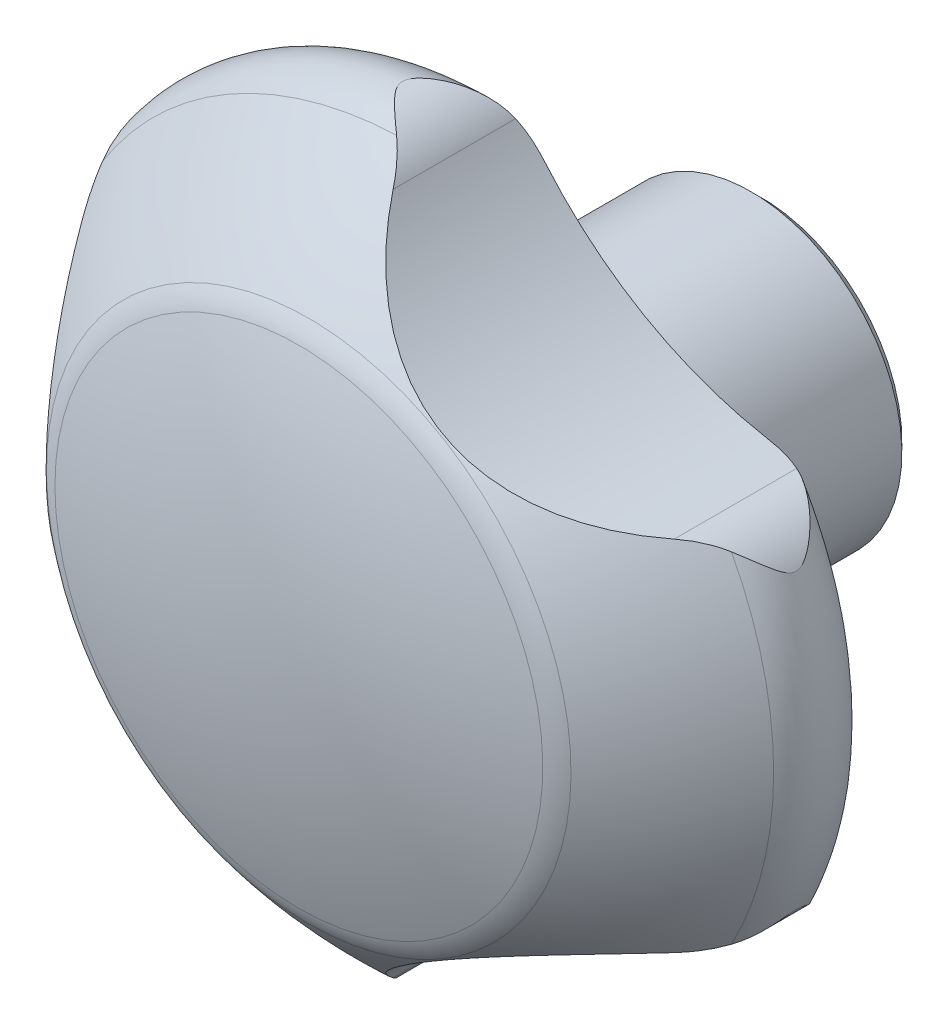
ISO-10303-21;
HEADER;
FILE_DESCRIPTION(('STEP AP214'),'2;1');
FILE_NAME('part.step','',(''),(''),'','','');
FILE_SCHEMA(('AUTOMOTIVE_DESIGN { 1 0 10303 214 1 1 1 1 }'));
ENDSEC;
DATA;
#1=APPLICATION_CONTEXT('core data for automotive mechanical design processes');
#2=APPLICATION_PROTOCOL_DEFINITION('international standard','automotive_design',2000,#1);
#3=PRODUCT_CONTEXT('',#1,'mechanical');
#4=PRODUCT('Part','Part','',(#3));
#5=PRODUCT_RELATED_PRODUCT_CATEGORY('part','',(#4));
#6=PRODUCT_DEFINITION_FORMATION('','',#4);
#7=PRODUCT_DEFINITION_CONTEXT('part definition',#1,'design');
#8=PRODUCT_DEFINITION('design','',#6,#7);
#9=PRODUCT_DEFINITION_SHAPE('','',#8);
#10=(LENGTH_UNIT() NAMED_UNIT(*) SI_UNIT(.MILLI.,.METRE.));
#11=(NAMED_UNIT(*) PLANE_ANGLE_UNIT() SI_UNIT($,.RADIAN.));
#12=(NAMED_UNIT(*) SI_UNIT($,.STERADIAN.) SOLID_ANGLE_UNIT());
#13=UNCERTAINTY_MEASURE_WITH_UNIT(LENGTH_MEASURE(1.E-05),#10,'distance_accuracy_value','');
#14=(GEOMETRIC_REPRESENTATION_CONTEXT(3) GLOBAL_UNCERTAINTY_ASSIGNED_CONTEXT((#13)) GLOBAL_UNIT_ASSIGNED_CONTEXT((#10,
#11,#12)) REPRESENTATION_CONTEXT('',''));
#15=CARTESIAN_POINT('',(0.,0.,0.));
#16=DIRECTION('',(0.,0.,1.));
#17=DIRECTION('',(1.,0.,0.));
#18=AXIS2_PLACEMENT_3D('',#15,#16,#17);
#19=CARTESIAN_POINT('',(0.,0.,16.875));
#20=DIRECTION('',(0.,0.,1.));
#21=DIRECTION('',(0.,-1.,0.));
#22=AXIS2_PLACEMENT_3D('',#19,#20,#21);
#23=TOROIDAL_SURFACE('',#22,16.625,3.375);
#24=CARTESIAN_POINT('',(0.,0.,13.5));
#25=DIRECTION('',(0.,0.,1.));
#26=DIRECTION('',(0.,-1.,0.));
#27=AXIS2_PLACEMENT_3D('',#24,#25,#26);
#28=CIRCLE('',#27,16.625);
#29=CARTESIAN_POINT('',(-15.1822150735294,-6.77428745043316,13.5));
#30=VERTEX_POINT('',#29);
#31=CARTESIAN_POINT('',(1.72440251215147,-16.5353276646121,13.5));
#32=VERTEX_POINT('',#31);
#33=EDGE_CURVE('E347',#30,#32,#28,.T.);
#34=ORIENTED_EDGE('',*,*,#33,.T.);
#35=CARTESIAN_POINT('',(15.4379786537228,-9.50595479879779,13.8541043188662));
#36=CARTESIAN_POINT('',(15.3037212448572,-9.51645099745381,13.7998826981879));
#37=CARTESIAN_POINT('',(15.1669261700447,-9.5285522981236,13.7526191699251));
#38=CARTESIAN_POINT('',(14.8901147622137,-9.55598611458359,13.6711535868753));
#39=CARTESIAN_POINT('',(14.7501059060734,-9.57131169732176,13.636923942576));
#40=CARTESIAN_POINT('',(14.4703418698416,-9.60499380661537,13.5808904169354));
#41=CARTESIAN_POINT('',(14.3306169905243,-9.62329916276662,13.5589005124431));
#42=CARTESIAN_POINT('',(14.0503009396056,-9.66307090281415,13.5254626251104));
#43=CARTESIAN_POINT('',(13.9097092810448,-9.68453925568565,13.5140212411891));
#44=CARTESIAN_POINT('',(13.5604307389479,-9.74171564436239,13.4973647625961));
#45=CARTESIAN_POINT('',(13.3517720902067,-9.77928160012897,13.4978565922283));
#46=CARTESIAN_POINT('',(12.9364664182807,-9.86087598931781,13.5161913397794));
#47=CARTESIAN_POINT('',(12.7298209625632,-9.90490908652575,13.5340468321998));
#48=CARTESIAN_POINT('',(12.3174684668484,-9.999577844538,13.5840167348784));
#49=CARTESIAN_POINT('',(12.1117957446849,-10.0502797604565,13.6162832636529));
#50=CARTESIAN_POINT('',(11.7042001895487,-10.1575906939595,13.6918190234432));
#51=CARTESIAN_POINT('',(11.5022759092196,-10.214197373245,13.7350839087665));
#52=CARTESIAN_POINT('',(10.9825776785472,-10.3686503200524,13.8577332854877));
#53=CARTESIAN_POINT('',(10.6675934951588,-10.4709447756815,13.9432631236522));
#54=CARTESIAN_POINT('',(10.2004875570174,-10.63545399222,14.0771430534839));
#55=CARTESIAN_POINT('',(10.0455515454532,-10.6921878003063,14.1227415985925));
#56=CARTESIAN_POINT('',(9.73714627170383,-10.8094624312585,14.2140018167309));
#57=CARTESIAN_POINT('',(9.58367689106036,-10.870002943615,14.2596634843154));
#58=CARTESIAN_POINT('',(9.28009247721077,-10.9941316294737,14.3483981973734));
#59=CARTESIAN_POINT('',(9.12996163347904,-11.0576605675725,14.3914997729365));
#60=CARTESIAN_POINT('',(8.83034428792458,-11.1888108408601,14.473670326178));
#61=CARTESIAN_POINT('',(8.68085784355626,-11.2564325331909,14.5127389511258));
#62=CARTESIAN_POINT('',(8.38263736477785,-11.3958170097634,14.5843050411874));
#63=CARTESIAN_POINT('',(8.23390239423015,-11.4675701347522,14.6168170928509));
#64=CARTESIAN_POINT('',(7.93690468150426,-11.6154557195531,14.6727872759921));
#65=CARTESIAN_POINT('',(7.78864179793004,-11.6915867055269,14.6962484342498));
#66=CARTESIAN_POINT('',(7.53921789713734,-11.8236597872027,14.7262894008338));
#67=CARTESIAN_POINT('',(7.43781839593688,-11.8784750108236,14.7358536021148));
#68=CARTESIAN_POINT('',(7.23569510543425,-11.9900171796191,14.7491398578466));
#69=CARTESIAN_POINT('',(7.13497124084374,-12.0467439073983,14.7528625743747));
#70=CARTESIAN_POINT('',(6.93446874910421,-12.161968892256,14.7542555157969));
#71=CARTESIAN_POINT('',(6.83469034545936,-12.2204675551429,14.7519243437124));
#72=CARTESIAN_POINT('',(6.63639652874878,-12.3390439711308,14.7413391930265));
#73=CARTESIAN_POINT('',(6.53788114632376,-12.3991217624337,14.733085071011));
#74=CARTESIAN_POINT('',(6.34135670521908,-12.5213047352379,14.7109864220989));
#75=CARTESIAN_POINT('',(6.24336300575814,-12.5834243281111,14.6970858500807));
#76=CARTESIAN_POINT('',(6.04904039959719,-12.708978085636,14.6643869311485));
#77=CARTESIAN_POINT('',(5.95271178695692,-12.7724124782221,14.6455877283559));
#78=CARTESIAN_POINT('',(5.66623604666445,-12.9646113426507,14.5830663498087));
#79=CARTESIAN_POINT('',(5.47866922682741,-13.0952277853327,14.5332294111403));
#80=CARTESIAN_POINT('',(5.15344663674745,-13.3299828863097,14.436931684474));
#81=CARTESIAN_POINT('',(5.01443996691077,-13.4331124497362,14.3924401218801));
#82=CARTESIAN_POINT('',(4.73971969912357,-13.642479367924,14.3006111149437));
#83=CARTESIAN_POINT('',(4.60400649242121,-13.7487170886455,14.2532733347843));
#84=CARTESIAN_POINT('',(4.33540085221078,-13.9646299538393,14.158085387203));
#85=CARTESIAN_POINT('',(4.20250995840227,-14.0743068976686,14.1102349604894));
#86=CARTESIAN_POINT('',(3.93928289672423,-14.2973419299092,14.0161154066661));
#87=CARTESIAN_POINT('',(3.80894682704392,-14.4107001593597,13.969846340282));
#88=CARTESIAN_POINT('',(3.42301483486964,-14.7552752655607,13.8368224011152));
#89=CARTESIAN_POINT('',(3.17076864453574,-14.9923790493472,13.7551864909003));
#90=CARTESIAN_POINT('',(2.67547480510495,-15.4831619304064,13.6198975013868));
#91=CARTESIAN_POINT('',(2.43241124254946,-15.7368100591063,13.5661937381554));
#92=CARTESIAN_POINT('',(1.9838165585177,-16.2307686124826,13.5051034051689));
#93=CARTESIAN_POINT('',(1.77713561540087,-16.4693787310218,13.4931932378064));
#94=CARTESIAN_POINT('',(1.47663315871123,-16.8333634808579,13.5091853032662));
#95=CARTESIAN_POINT('',(1.37809953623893,-16.955640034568,13.5201448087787));
#96=CARTESIAN_POINT('',(1.1848123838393,-17.2013258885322,13.5547877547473));
#97=CARTESIAN_POINT('',(1.09005659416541,-17.3247344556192,13.5784634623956));
#98=CARTESIAN_POINT('',(0.912640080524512,-17.5613943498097,13.6374382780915));
#99=CARTESIAN_POINT('',(0.829623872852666,-17.674651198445,13.67162881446));
#100=CARTESIAN_POINT('',(0.667982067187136,-17.8999656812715,13.7529327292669));
#101=CARTESIAN_POINT('',(0.589364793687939,-18.0120207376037,13.8000696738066));
#102=CARTESIAN_POINT('',(0.513385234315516,-18.1226937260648,13.854121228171));
#103=B_SPLINE_CURVE_WITH_KNOTS('',3,(#35,#36,#37,#38,#39,#40,#41,#42,#43,#44,#45,#46,#47,#48,
#49,#50,#51,#52,#53,#54,#55,#56,#57,#58,#59,#60,#61,#62,#63,#64,#65,#66,#67,#68,#69,#70,#71,#72,
#73,#74,#75,#76,#77,#78,#79,#80,#81,#82,#83,#84,#85,#86,#87,#88,#89,#90,#91,#92,#93,#94,#95,#96,
#97,#98,#99,#100,#101,#102),.UNSPECIFIED.,.F.,.F.,(4,2,2,2,2,2,2,2,2,2,2,2,2,2,2,2,2,2,2,2,2,2,
2,2,2,2,2,2,2,2,2,2,2,4),(0.,0.435126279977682,0.869326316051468,1.29673327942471,
1.72440743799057,2.35940170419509,2.9948561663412,3.6371829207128,4.27925627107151,
5.30456736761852,5.81809451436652,6.33157982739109,6.83737353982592,7.3432114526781,
7.84791129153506,8.35244220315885,8.69928448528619,9.04608745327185,9.39297045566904,
9.73986185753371,10.0902839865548,10.4407673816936,11.1419829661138,11.678050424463,
12.2141812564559,12.7505974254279,13.2870341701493,14.3529821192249,15.4169890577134,
16.3615250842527,16.8333167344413,17.3048218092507,17.7377773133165,18.1715262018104),.UNSPECIFIED.);
#104=CARTESIAN_POINT('',(0.513522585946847,-18.1224937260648,13.8540235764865));
#105=VERTEX_POINT('',#104);
#106=EDGE_CURVE('E157',#32,#105,#103,.T.);
#107=ORIENTED_EDGE('',*,*,#106,.T.);
#108=CARTESIAN_POINT('',(-0.717939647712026,-19.2832690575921,18.9372855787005));
#109=CARTESIAN_POINT('',(-0.817379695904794,-19.3432732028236,18.8547398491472));
#110=CARTESIAN_POINT('',(-0.918151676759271,-19.3981162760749,18.7701037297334));
#111=CARTESIAN_POINT('',(-1.12111855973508,-19.4978445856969,18.5964609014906));
#112=CARTESIAN_POINT('',(-1.22331515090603,-19.5427167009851,18.5074486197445));
#113=CARTESIAN_POINT('',(-1.42803648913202,-19.6228738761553,18.3247100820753));
#114=CARTESIAN_POINT('',(-1.53056088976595,-19.6581193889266,18.2309662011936));
#115=CARTESIAN_POINT('',(-1.73342148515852,-19.7190946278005,18.0382835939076));
#116=CARTESIAN_POINT('',(-1.83375977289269,-19.7448338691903,17.9393501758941));
#117=CARTESIAN_POINT('',(-1.98769365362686,-19.7784353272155,17.7764480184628));
#118=CARTESIAN_POINT('',(-2.04336935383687,-19.7892799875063,17.7150559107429));
#119=CARTESIAN_POINT('',(-2.15093749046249,-19.8080166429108,17.5883776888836));
#120=CARTESIAN_POINT('',(-2.20282539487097,-19.8159051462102,17.5230870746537));
#121=CARTESIAN_POINT('',(-2.28824219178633,-19.8273856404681,17.4024524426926));
#122=CARTESIAN_POINT('',(-2.32325956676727,-19.8315471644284,17.3482347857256));
#123=CARTESIAN_POINT('',(-2.38559928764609,-19.8382748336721,17.2354516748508));
#124=CARTESIAN_POINT('',(-2.41295247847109,-19.8408474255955,17.1769048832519));
#125=CARTESIAN_POINT('',(-2.44702991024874,-19.8438432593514,17.0774131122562));
#126=CARTESIAN_POINT('',(-2.45763985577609,-19.8447083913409,17.037853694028));
#127=CARTESIAN_POINT('',(-2.47204410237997,-19.8458612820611,16.9575226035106));
#128=CARTESIAN_POINT('',(-2.47585221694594,-19.846150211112,16.9167535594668));
#129=CARTESIAN_POINT('',(-2.47597002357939,-19.8461593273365,16.8350870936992));
#130=CARTESIAN_POINT('',(-2.47225828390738,-19.8458778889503,16.7941896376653));
#131=CARTESIAN_POINT('',(-2.45799115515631,-19.8447369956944,16.7136041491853));
#132=CARTESIAN_POINT('',(-2.44742308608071,-19.8438764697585,16.6739185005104));
#133=CARTESIAN_POINT('',(-2.41334829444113,-19.8408842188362,16.573965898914));
#134=CARTESIAN_POINT('',(-2.38589255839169,-19.8383048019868,16.5151006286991));
#135=CARTESIAN_POINT('',(-2.32323413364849,-19.8315461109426,16.4016974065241));
#136=CARTESIAN_POINT('',(-2.28799496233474,-19.8273592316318,16.3471815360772));
#137=CARTESIAN_POINT('',(-2.18869181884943,-19.8139941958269,16.2069806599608));
#138=CARTESIAN_POINT('',(-2.12082733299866,-19.8033419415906,16.124178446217));
#139=CARTESIAN_POINT('',(-1.97976151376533,-19.7770498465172,15.9640106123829));
#140=CARTESIAN_POINT('',(-1.9065479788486,-19.7613983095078,15.8866582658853));
#141=CARTESIAN_POINT('',(-1.75721668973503,-19.7248160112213,15.7354478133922));
#142=CARTESIAN_POINT('',(-1.68108797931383,-19.703863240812,15.6616058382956));
#143=CARTESIAN_POINT('',(-1.52779023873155,-19.6565654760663,15.516967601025));
#144=CARTESIAN_POINT('',(-1.45062224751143,-19.6302255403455,15.4461685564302));
#145=CARTESIAN_POINT('',(-1.26477650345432,-19.5601947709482,15.2789509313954));
#146=CARTESIAN_POINT('',(-1.15599243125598,-19.5137969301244,15.1837668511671));
#147=CARTESIAN_POINT('',(-0.939748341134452,-19.4096394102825,14.9980805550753));
#148=CARTESIAN_POINT('',(-0.832289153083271,-19.3518729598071,14.9075811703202));
#149=CARTESIAN_POINT('',(-0.62074764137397,-19.22498394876,14.7320768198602));
#150=CARTESIAN_POINT('',(-0.51665026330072,-19.1559241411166,14.6470449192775));
#151=CARTESIAN_POINT('',(-0.312627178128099,-19.0059521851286,14.4826320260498));
#152=CARTESIAN_POINT('',(-0.212701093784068,-18.9250411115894,14.403250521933));
#153=CARTESIAN_POINT('',(-0.00138540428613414,-18.7358268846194,14.2377557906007));
#154=CARTESIAN_POINT('',(0.108951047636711,-18.6252079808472,14.1528947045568));
#155=CARTESIAN_POINT('',(0.266841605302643,-18.4464783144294,14.0340195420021));
#156=CARTESIAN_POINT('',(0.318314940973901,-18.3846072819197,13.9957170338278));
#157=CARTESIAN_POINT('',(0.418305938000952,-18.2566207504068,13.9223190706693));
#158=CARTESIAN_POINT('',(0.466821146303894,-18.1905018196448,13.8872262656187));
#159=CARTESIAN_POINT('',(0.513659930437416,-18.1222937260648,13.8539259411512));
#160=B_SPLINE_CURVE_WITH_KNOTS('',3,(#108,#109,#110,#111,#112,#113,#114,#115,#116,#117,#118,
#119,#120,#121,#122,#123,#124,#125,#126,#127,#128,#129,#130,#131,#132,#133,#134,#135,#136,#137,
#138,#139,#140,#141,#142,#143,#144,#145,#146,#147,#148,#149,#150,#151,#152,#153,#154,#155,#156,
#157,#158,#159),.UNSPECIFIED.,.F.,.F.,(4,2,2,2,2,2,2,2,2,2,2,2,2,2,2,2,2,2,2,2,2,2,2,2,2,4),(0.,
0.427303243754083,0.85516550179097,1.284759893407,1.71392311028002,1.96454612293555,
2.21546424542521,2.4091715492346,2.60208768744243,2.72451026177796,2.8466839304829,
2.96920628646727,3.09195588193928,3.28584516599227,3.48066330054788,3.80264986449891,
4.12539532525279,4.44950336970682,4.77330845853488,5.22823009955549,5.68342352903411,
6.13616858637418,6.58887260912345,7.12078121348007,7.3879971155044,7.65543167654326),.UNSPECIFIED.);
#161=CARTESIAN_POINT('',(-0.718180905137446,-19.2834145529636,18.9370855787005));
#162=VERTEX_POINT('',#161);
#163=EDGE_CURVE('E152',#162,#105,#160,.T.);
#164=ORIENTED_EDGE('',*,*,#163,.F.);
#165=CARTESIAN_POINT('',(0.,0.,18.9370855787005));
#166=DIRECTION('',(0.,0.,1.));
#167=DIRECTION('',(0.,-1.,0.));
#168=AXIS2_PLACEMENT_3D('',#165,#166,#167);
#169=CIRCLE('',#168,19.2967836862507);
#170=CARTESIAN_POINT('',(-16.3408364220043,-10.2636701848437,18.9370855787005));
#171=VERTEX_POINT('',#170);
#172=EDGE_CURVE('E353',#171,#162,#169,.T.);
#173=ORIENTED_EDGE('',*,*,#172,.F.);
#174=CARTESIAN_POINT('',(-15.9512057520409,-8.61632325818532,13.85393438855));
#175=CARTESIAN_POINT('',(-16.0093028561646,-8.73799434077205,13.9082231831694));
#176=CARTESIAN_POINT('',(-16.060350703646,-8.86072630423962,13.9672208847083));
#177=CARTESIAN_POINT('',(-16.1489720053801,-9.10667626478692,14.0931003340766));
#178=CARTESIAN_POINT('',(-16.1865737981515,-9.22989267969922,14.1599651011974));
#179=CARTESIAN_POINT('',(-16.2490254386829,-9.47514620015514,14.2999689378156));
#180=CARTESIAN_POINT('',(-16.2739323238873,-9.59718611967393,14.3730781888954));
#181=CARTESIAN_POINT('',(-16.312066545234,-9.83966938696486,14.5248830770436));
#182=CARTESIAN_POINT('',(-16.3252874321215,-9.96011181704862,14.6035817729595));
#183=CARTESIAN_POINT('',(-16.3414570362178,-10.2078052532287,14.7722047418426));
#184=CARTESIAN_POINT('',(-16.3435129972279,-10.3348436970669,14.8625247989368));
#185=CARTESIAN_POINT('',(-16.336009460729,-10.5848023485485,15.0482599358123));
#186=CARTESIAN_POINT('',(-16.3264474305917,-10.7077216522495,15.1436761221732));
#187=CARTESIAN_POINT('',(-16.2969095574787,-10.9479894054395,15.3394481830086));
#188=CARTESIAN_POINT('',(-16.2769460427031,-11.0653442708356,15.4397980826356));
#189=CARTESIAN_POINT('',(-16.2281050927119,-11.2928347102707,15.6462350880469));
#190=CARTESIAN_POINT('',(-16.1992353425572,-11.4029764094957,15.7523171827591));
#191=CARTESIAN_POINT('',(-16.1493571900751,-11.5664047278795,15.9245079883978));
#192=CARTESIAN_POINT('',(-16.1304655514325,-11.6234147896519,15.9877083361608));
#193=CARTESIAN_POINT('',(-16.0916521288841,-11.7327235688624,16.1179814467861));
#194=CARTESIAN_POINT('',(-16.071729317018,-11.7850174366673,16.1850580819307));
#195=CARTESIAN_POINT('',(-16.0366015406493,-11.8722875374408,16.3108301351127));
#196=CARTESIAN_POINT('',(-16.0212499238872,-11.9086355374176,16.3685187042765));
#197=CARTESIAN_POINT('',(-15.9929667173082,-11.9733734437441,16.4887986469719));
#198=CARTESIAN_POINT('',(-15.9800259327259,-12.0017938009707,16.5513700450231));
#199=CARTESIAN_POINT('',(-15.9639727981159,-12.0363977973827,16.6554709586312));
#200=CARTESIAN_POINT('',(-15.9590035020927,-12.0469244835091,16.6952167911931));
#201=CARTESIAN_POINT('',(-15.9519431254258,-12.0618077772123,16.7760642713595));
#202=CARTESIAN_POINT('',(-15.9498449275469,-12.0661796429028,16.817162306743));
#203=CARTESIAN_POINT('',(-15.9489671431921,-12.0680139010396,16.8997426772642));
#204=CARTESIAN_POINT('',(-15.9502024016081,-12.0654453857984,16.9412259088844));
#205=CARTESIAN_POINT('',(-15.9557420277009,-12.0538107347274,17.0230710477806));
#206=CARTESIAN_POINT('',(-15.9600518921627,-12.0447329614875,17.0634308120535));
#207=CARTESIAN_POINT('',(-15.9737226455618,-12.0154681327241,17.1624272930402));
#208=CARTESIAN_POINT('',(-15.9845397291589,-11.9919731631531,17.2198462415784));
#209=CARTESIAN_POINT('',(-16.0087265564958,-11.9375757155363,17.3305586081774));
#210=CARTESIAN_POINT('',(-16.0221088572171,-11.9066365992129,17.383829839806));
#211=CARTESIAN_POINT('',(-16.0584086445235,-11.8191710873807,17.519682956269));
#212=CARTESIAN_POINT('',(-16.0820171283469,-11.7588131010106,17.5995627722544));
#213=CARTESIAN_POINT('',(-16.1279945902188,-11.6311833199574,17.7540647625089));
#214=CARTESIAN_POINT('',(-16.1503604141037,-11.563895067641,17.8286736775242));
#215=CARTESIAN_POINT('',(-16.1924155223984,-11.424378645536,17.9744739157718));
#216=CARTESIAN_POINT('',(-16.2120945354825,-11.3521330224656,18.0456514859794));
#217=CARTESIAN_POINT('',(-16.2477973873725,-11.2041859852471,18.1850918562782));
#218=CARTESIAN_POINT('',(-16.26382517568,-11.1284884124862,18.253357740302));
#219=CARTESIAN_POINT('',(-16.2891263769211,-10.9885286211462,18.3750655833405));
#220=CARTESIAN_POINT('',(-16.2991008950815,-10.9247435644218,18.4289123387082));
#221=CARTESIAN_POINT('',(-16.3160522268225,-10.795535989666,18.535121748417));
#222=CARTESIAN_POINT('',(-16.3230284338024,-10.7301131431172,18.5874841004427));
#223=CARTESIAN_POINT('',(-16.3337316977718,-10.5984732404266,18.690270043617));
#224=CARTESIAN_POINT('',(-16.3374881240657,-10.5322690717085,18.7407070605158));
#225=CARTESIAN_POINT('',(-16.3416872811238,-10.3986745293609,18.8401074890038));
#226=CARTESIAN_POINT('',(-16.3421304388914,-10.331284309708,18.889071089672));
#227=CARTESIAN_POINT('',(-16.3408310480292,-10.2633885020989,18.9372855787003));
#228=B_SPLINE_CURVE_WITH_KNOTS('',3,(#174,#175,#176,#177,#178,#179,#180,#181,#182,#183,#184,
#185,#186,#187,#188,#189,#190,#191,#192,#193,#194,#195,#196,#197,#198,#199,#200,#201,#202,#203,
#204,#205,#206,#207,#208,#209,#210,#211,#212,#213,#214,#215,#216,#217,#218,#219,#220,#221,#222,
#223,#224,#225,#226,#227),.UNSPECIFIED.,.F.,.F.,(4,2,2,2,2,2,2,2,2,2,2,2,2,2,2,2,2,2,2,2,2,2,2,
2,2,2,4),(0.,0.435551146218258,0.870178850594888,1.3028361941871,1.73573216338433,
2.20278289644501,2.66993546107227,3.13653559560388,3.6027342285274,3.86416270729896,
4.12585701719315,4.33521208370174,4.54375156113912,4.6675353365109,4.79101170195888,
4.91503885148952,5.03928829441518,5.22712917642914,5.41591418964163,5.72375561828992,
6.03234572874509,6.34208434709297,6.65148631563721,6.90361247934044,7.15578962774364,
7.40564128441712,7.65546074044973),.UNSPECIFIED.);
#229=CARTESIAN_POINT('',(-15.9513012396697,-8.61652325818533,13.8540235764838));
#230=VERTEX_POINT('',#229);
#231=EDGE_CURVE('E147',#230,#171,#228,.T.);
#232=ORIENTED_EDGE('',*,*,#231,.F.);
#233=CARTESIAN_POINT('',(-15.9513967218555,-8.61672325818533,13.8541127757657));
#234=CARTESIAN_POINT('',(-15.8933579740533,-8.49520512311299,13.7998904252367));
#235=CARTESIAN_POINT('',(-15.8354404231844,-8.3706867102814,13.7526261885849));
#236=CARTESIAN_POINT('',(-15.7207929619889,-8.11724451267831,13.6711592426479));
#237=CARTESIAN_POINT('',(-15.6640607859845,-7.98833066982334,13.6369289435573));
#238=CARTESIAN_POINT('',(-15.553348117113,-7.72920714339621,13.5808941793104));
#239=CARTESIAN_POINT('',(-15.4993384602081,-7.5990492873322,13.5589036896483));
#240=CARTESIAN_POINT('',(-15.3936235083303,-7.33640278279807,13.5254646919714));
#241=CARTESIAN_POINT('',(-15.3419196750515,-7.20391272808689,13.5140227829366));
#242=CARTESIAN_POINT('',(-15.2167967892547,-6.87284203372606,13.4973651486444));
#243=CARTESIAN_POINT('',(-15.1450008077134,-6.67335688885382,13.4978562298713));
#244=CARTESIAN_POINT('',(-15.0080112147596,-6.27289743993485,13.516189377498));
#245=CARTESIAN_POINT('',(-14.9428224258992,-6.07192216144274,13.5340440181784));
#246=CARTESIAN_POINT('',(-14.8186319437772,-5.66748299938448,13.58401216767));
#247=CARTESIAN_POINT('',(-14.7597047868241,-5.46401570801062,13.6162777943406));
#248=CARTESIAN_POINT('',(-14.648841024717,-5.05737505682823,13.6918117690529));
#249=CARTESIAN_POINT('',(-14.59690167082,-4.85420161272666,13.7350757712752));
#250=CARTESIAN_POINT('',(-14.4708109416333,-4.32690041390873,13.8577245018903));
#251=CARTESIAN_POINT('',(-14.4019069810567,-4.00296459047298,13.9432550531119));
#252=CARTESIAN_POINT('',(-14.310821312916,-3.51617796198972,14.0771364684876));
#253=CARTESIAN_POINT('',(-14.2824856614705,-3.35363039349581,14.1227355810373));
#254=CARTESIAN_POINT('',(-14.2298448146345,-3.02790199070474,14.2139970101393));
#255=CARTESIAN_POINT('',(-14.2055392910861,-2.86472120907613,14.25965932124));
#256=CARTESIAN_POINT('',(-14.1612448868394,-2.53974081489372,14.3483953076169));
#257=CARTESIAN_POINT('',(-14.1411967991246,-2.37795712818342,14.3914975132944));
#258=CARTESIAN_POINT('',(-14.1049670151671,-2.05290153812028,14.4736692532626));
#259=CARTESIAN_POINT('',(-14.0887856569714,-1.889629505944,14.5127384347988));
#260=CARTESIAN_POINT('',(-14.0603855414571,-1.56166647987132,14.584305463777));
#261=CARTESIAN_POINT('',(-14.0481579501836,-1.39697950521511,14.6168178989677));
#262=CARTESIAN_POINT('',(-14.0277316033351,-1.06582480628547,14.6727885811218));
#263=CARTESIAN_POINT('',(-14.0195315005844,-0.899357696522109,14.6962498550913));
#264=CARTESIAN_POINT('',(-14.0091982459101,-0.6173101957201,14.726290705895));
#265=CARTESIAN_POINT('',(-14.0059699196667,-0.502086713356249,14.735854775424));
#266=CARTESIAN_POINT('',(-14.0015067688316,-0.271269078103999,14.7491406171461));
#267=CARTESIAN_POINT('',(-14.0002717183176,-0.155674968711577,14.7528630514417));
#268=CARTESIAN_POINT('',(-13.9998084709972,0.0755804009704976,14.7542552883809));
#269=CARTESIAN_POINT('',(-14.0005807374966,0.191241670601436,14.7519236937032));
#270=CARTESIAN_POINT('',(-14.0041243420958,0.422259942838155,14.7413375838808));
#271=CARTESIAN_POINT('',(-14.0068957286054,0.537616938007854,14.7330829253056));
#272=CARTESIAN_POINT('',(-14.0144474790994,0.768906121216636,14.7109831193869));
#273=CARTESIAN_POINT('',(-14.0192480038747,0.884832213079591,14.6970819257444));
#274=CARTESIAN_POINT('',(-14.0308199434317,1.11589989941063,14.6643817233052));
#275=CARTESIAN_POINT('',(-14.0375917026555,1.23104135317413,14.6455818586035));
#276=CARTESIAN_POINT('',(-14.0608038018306,1.57523971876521,14.5830584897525));
#277=CARTESIAN_POINT('',(-14.0801382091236,1.80298796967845,14.5332202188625));
#278=CARTESIAN_POINT('',(-14.12083142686,2.20201415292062,14.4369219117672));
#279=CARTESIAN_POINT('',(-14.1406406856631,2.37395752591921,14.3924312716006));
#280=CARTESIAN_POINT('',(-14.1845969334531,2.71654638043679,14.3006044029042));
#281=CARTESIAN_POINT('',(-14.2087444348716,2.88719170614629,14.253267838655));
#282=CARTESIAN_POINT('',(-14.2614264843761,3.22775824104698,14.1580824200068));
#283=CARTESIAN_POINT('',(-14.2899633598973,3.39767901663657,14.1102333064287));
#284=CARTESIAN_POINT('',(-14.3515021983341,3.7371487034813,14.0161162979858));
#285=CARTESIAN_POINT('',(-14.3845043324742,3.90669760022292,13.9698484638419));
#286=CARTESIAN_POINT('',(-14.4899459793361,4.41319851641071,13.8368278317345));
#287=CARTESIAN_POINT('',(-14.5691582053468,4.75019302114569,13.755193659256));
#288=CARTESIAN_POINT('',(-14.7465355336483,5.42450354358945,13.6199060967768));
#289=CARTESIAN_POINT('',(-14.8446658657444,5.7618178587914,13.5662020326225));
#290=CARTESIAN_POINT('',(-15.0481450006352,6.39728605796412,13.5051069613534));
#291=CARTESIAN_POINT('',(-15.1514470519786,6.69558548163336,13.4931939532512));
#292=CARTESIAN_POINT('',(-15.3164163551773,7.13782595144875,13.509181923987));
#293=CARTESIAN_POINT('',(-15.3730443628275,7.28429865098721,13.5201400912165));
#294=CARTESIAN_POINT('',(-15.4891715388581,7.57453684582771,13.5547804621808));
#295=CARTESIAN_POINT('',(-15.5486689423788,7.71830393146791,13.5784549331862));
#296=CARTESIAN_POINT('',(-15.6649160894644,7.99028741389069,13.6374281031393));
#297=CARTESIAN_POINT('',(-15.721492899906,8.11881435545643,13.671618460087));
#298=CARTESIAN_POINT('',(-15.8358034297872,8.37146611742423,13.7529227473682));
#299=CARTESIAN_POINT('',(-15.8935390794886,8.49558243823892,13.8000602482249));
#300=CARTESIAN_POINT('',(-15.9513967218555,8.61672325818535,13.8541127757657));
#301=B_SPLINE_CURVE_WITH_KNOTS('',3,(#233,#234,#235,#236,#237,#238,#239,#240,#241,#242,#243,
#244,#245,#246,#247,#248,#249,#250,#251,#252,#253,#254,#255,#256,#257,#258,#259,#260,#261,#262,
#263,#264,#265,#266,#267,#268,#269,#270,#271,#272,#273,#274,#275,#276,#277,#278,#279,#280,#281,
#282,#283,#284,#285,#286,#287,#288,#289,#290,#291,#292,#293,#294,#295,#296,#297,#298,#299,#300),
.UNSPECIFIED.,.F.,.F.,(4,2,2,2,2,2,2,2,2,2,2,2,2,2,2,2,2,2,2,2,2,2,2,2,2,2,2,2,2,2,2,2,2,4),(0.,
0.435126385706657,0.869326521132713,1.29673356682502,1.72440780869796,2.35939750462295,
2.99484738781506,3.6371695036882,4.27923821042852,5.30456286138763,5.81809684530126,
6.33158899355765,6.83738933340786,7.34323387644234,7.84794026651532,8.35247771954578,
8.6993239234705,9.04613081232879,9.39301775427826,9.73991309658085,10.0903392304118,
10.440826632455,11.1420502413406,11.6781033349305,12.2142197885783,12.7506215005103,
13.2870437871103,14.3529633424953,15.4169421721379,16.3614882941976,16.8332849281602,
17.3047949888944,17.7377638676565,18.1715262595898),.UNSPECIFIED.);
#302=EDGE_CURVE('E138',#230,#30,#301,.T.);
#303=ORIENTED_EDGE('',*,*,#302,.T.);
#304=EDGE_LOOP('',(#34,#107,#164,#173,#232,#303));
#305=FACE_BOUND('',#304,.T.);
#306=ADVANCED_FACE('F14',(#305),#23,.T.);
#307=CARTESIAN_POINT('',(0.513659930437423,18.1222937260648,13.8539259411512));
#308=CARTESIAN_POINT('',(0.437338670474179,18.2334434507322,13.9082142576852));
#309=CARTESIAN_POINT('',(0.356573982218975,18.3390187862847,13.967211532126));
#310=CARTESIAN_POINT('',(0.187886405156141,18.5387433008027,14.0930902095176));
#311=CARTESIAN_POINT('',(0.0999790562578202,18.6329162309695,14.1599546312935));
#312=CARTESIAN_POINT('',(-0.0811903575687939,18.8096288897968,14.2999578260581));
#313=CARTESIAN_POINT('',(-0.174426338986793,18.8922194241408,14.373066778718));
#314=CARTESIAN_POINT('',(-0.36535547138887,19.0464874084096,14.5248711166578));
#315=CARTESIAN_POINT('',(-0.463051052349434,19.1181588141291,14.6035695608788));
#316=CARTESIAN_POINT('',(-0.669474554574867,19.2560098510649,14.7721918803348));
#317=CARTESIAN_POINT('',(-0.778464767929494,19.3213100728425,14.8625115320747));
#318=CARTESIAN_POINT('',(-0.998686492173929,19.4397921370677,15.0482458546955));
#319=CARTESIAN_POINT('',(-1.10991848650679,19.4929713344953,15.143661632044));
#320=CARTESIAN_POINT('',(-1.33276498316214,19.5875256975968,15.3394328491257));
#321=CARTESIAN_POINT('',(-1.44437887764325,19.6289147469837,15.4397823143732));
#322=CARTESIAN_POINT('',(-1.66581169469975,19.7003635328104,15.6462183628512));
#323=CARTESIAN_POINT('',(-1.77563207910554,19.7304329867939,15.7522999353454));
#324=CARTESIAN_POINT('',(-1.94210548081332,19.768952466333,15.9244907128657));
#325=CARTESIAN_POINT('',(-2.00092455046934,19.7810973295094,15.9876916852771));
#326=CARTESIAN_POINT('',(-2.11499770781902,19.8021391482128,16.117966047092));
#327=CARTESIAN_POINT('',(-2.17024810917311,19.8110327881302,16.1850433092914));
#328=CARTESIAN_POINT('',(-2.26339292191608,19.8242469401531,16.310817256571));
#329=CARTESIAN_POINT('',(-2.30254856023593,19.8291263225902,16.368507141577));
#330=CARTESIAN_POINT('',(-2.37275774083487,19.8370017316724,16.4887899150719));
#331=CARTESIAN_POINT('',(-2.40384225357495,19.8400050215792,16.5513628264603));
#332=CARTESIAN_POINT('',(-2.44183813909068,19.8434047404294,16.6554654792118));
#333=CARTESIAN_POINT('',(-2.45343948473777,19.8443645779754,16.6952113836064));
#334=CARTESIAN_POINT('',(-2.46985963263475,19.8456918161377,16.7760590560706));
#335=CARTESIAN_POINT('',(-2.47469520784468,19.846060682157,16.8171572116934));
#336=CARTESIAN_POINT('',(-2.47672322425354,19.8462176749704,16.899737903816));
#337=CARTESIAN_POINT('',(-2.47388147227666,19.8460032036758,16.9412213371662));
#338=CARTESIAN_POINT('',(-2.46103620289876,19.8449833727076,17.0230669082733));
#339=CARTESIAN_POINT('',(-2.45101985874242,19.8441769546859,17.0634269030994));
#340=CARTESIAN_POINT('',(-2.41884096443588,19.8413838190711,17.1624231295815));
#341=CARTESIAN_POINT('',(-2.39308569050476,19.8390042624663,17.2198416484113));
#342=CARTESIAN_POINT('',(-2.33388374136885,19.8327520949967,17.3305532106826));
#343=CARTESIAN_POINT('',(-2.30039905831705,19.8288720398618,17.3838240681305));
#344=CARTESIAN_POINT('',(-2.20650345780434,19.8165761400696,17.5196758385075));
#345=CARTESIAN_POINT('',(-2.14242883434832,19.8068429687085,17.599554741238));
#346=CARTESIAN_POINT('',(-2.00891180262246,19.7828464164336,17.7540549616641));
#347=CARTESIAN_POINT('',(-1.93945671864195,19.7685720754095,17.8286630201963));
#348=CARTESIAN_POINT('',(-1.7976066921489,19.7352356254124,17.9744615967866));
#349=CARTESIAN_POINT('',(-1.72520176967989,19.7161558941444,18.0456383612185));
#350=CARTESIAN_POINT('',(-1.57922667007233,19.6731032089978,18.1850771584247));
#351=CARTESIAN_POINT('',(-1.50565784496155,19.6491355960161,18.2533422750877));
#352=CARTESIAN_POINT('',(-1.37179809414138,19.6010677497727,18.3750509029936));
#353=CARTESIAN_POINT('',(-1.31156984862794,19.5778131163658,18.4288991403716));
#354=CARTESIAN_POINT('',(-1.19119410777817,19.5278888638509,18.5351114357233));
#355=CARTESIAN_POINT('',(-1.13104663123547,19.5012185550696,18.587475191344));
#356=CARTESIAN_POINT('',(-1.01168849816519,19.44466683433,18.6902638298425));
#357=CARTESIAN_POINT('',(-0.952474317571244,19.4148173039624,18.7407021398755));
#358=CARTESIAN_POINT('',(-0.834675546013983,19.351655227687,18.8401050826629));
#359=CARTESIAN_POINT('',(-0.776090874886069,19.318343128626,18.8890699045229));
#360=CARTESIAN_POINT('',(-0.717939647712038,19.2832690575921,18.9372855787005));
#361=B_SPLINE_CURVE_WITH_KNOTS('',3,(#307,#308,#309,#310,#311,#312,#313,#314,#315,#316,#317,
#318,#319,#320,#321,#322,#323,#324,#325,#326,#327,#328,#329,#330,#331,#332,#333,#334,#335,#336,
#337,#338,#339,#340,#341,#342,#343,#344,#345,#346,#347,#348,#349,#350,#351,#352,#353,#354,#355,
#356,#357,#358,#359,#360),.UNSPECIFIED.,.F.,.F.,(4,2,2,2,2,2,2,2,2,2,2,2,2,2,2,2,2,2,2,2,2,2,2,
2,2,2,4),(0.,0.435551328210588,0.870179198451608,1.30283659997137,1.73573263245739,
2.20278258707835,2.6699343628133,3.13653373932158,3.60273163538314,3.86416387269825,
4.12586198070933,4.3352229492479,4.54376827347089,4.6675525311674,4.79102936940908,
4.91505705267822,5.03930702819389,5.22714611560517,5.41592931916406,5.72376636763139,
6.03235209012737,6.3420863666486,6.65148399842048,6.90361648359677,7.15579995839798,
7.40565775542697,7.65548334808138),.UNSPECIFIED.);
#362=CARTESIAN_POINT('',(0.513522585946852,18.1224937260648,13.8540235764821));
#363=VERTEX_POINT('',#362);
#364=CARTESIAN_POINT('',(-0.718180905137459,19.2834145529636,18.9370855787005));
#365=VERTEX_POINT('',#364);
#366=EDGE_CURVE('E275',#363,#365,#361,.T.);
#367=ORIENTED_EDGE('',*,*,#366,.F.);
#368=CARTESIAN_POINT('',(0.513385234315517,18.1226937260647,13.854121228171));
#369=CARTESIAN_POINT('',(0.589603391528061,18.0116717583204,13.7998981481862));
#370=CARTESIAN_POINT('',(0.668480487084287,17.8992545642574,13.7526332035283));
#371=CARTESIAN_POINT('',(0.830643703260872,17.6732459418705,13.6711648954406));
#372=CARTESIAN_POINT('',(0.913920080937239,17.5596575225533,13.6369339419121));
#373=CARTESIAN_POINT('',(1.08297094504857,17.3342157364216,13.5808979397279));
#374=CARTESIAN_POINT('',(1.16868596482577,17.2223630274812,13.5589068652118));
#375=CARTESIAN_POINT('',(1.34328674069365,16.9994878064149,13.5254667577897));
#376=CARTESIAN_POINT('',(1.43217444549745,16.888465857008,13.5140243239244));
#377=CARTESIAN_POINT('',(1.65632734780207,16.6145718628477,13.4973655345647));
#378=CARTESIAN_POINT('',(1.79318737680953,16.4526531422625,13.4978558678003));
#379=CARTESIAN_POINT('',(2.07149824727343,16.1337888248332,13.5161874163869));
#380=CARTESIAN_POINT('',(2.21295234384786,15.9768469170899,13.5340412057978));
#381=CARTESIAN_POINT('',(2.50110924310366,15.6670768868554,13.5840076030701));
#382=CARTESIAN_POINT('',(2.6478522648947,15.5143116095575,13.6162723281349));
#383=CARTESIAN_POINT('',(2.94457900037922,15.214981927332,13.6918045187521));
#384=CARTESIAN_POINT('',(3.09456141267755,15.0684150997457,13.7350676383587));
#385=CARTESIAN_POINT('',(3.48817385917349,14.6955637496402,13.8577157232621));
#386=CARTESIAN_POINT('',(3.73426151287,14.473919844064,13.9432469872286));
#387=CARTESIAN_POINT('',(4.1102928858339,14.151639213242,14.0771298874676));
#388=CARTESIAN_POINT('',(4.23689695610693,14.0458244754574,14.122729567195));
#389=CARTESIAN_POINT('',(4.49266880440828,13.8373689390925,14.2139922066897));
#390=CARTESIAN_POINT('',(4.62183637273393,13.7347278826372,14.259655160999));
#391=CARTESIAN_POINT('',(4.8811337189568,13.5338748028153,14.348392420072));
#392=CARTESIAN_POINT('',(5.01122009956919,13.4356194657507,14.3914952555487));
#393=CARTESIAN_POINT('',(5.27461497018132,13.2417131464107,14.4736681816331));
#394=CARTESIAN_POINT('',(5.40792374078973,13.1460623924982,14.5127379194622));
#395=CARTESIAN_POINT('',(5.67775151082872,12.9574831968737,14.5843058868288));
#396=CARTESIAN_POINT('',(5.81426261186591,12.8645491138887,14.6168187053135));
#397=CARTESIAN_POINT('',(6.0908414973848,12.6812797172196,14.6727898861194));
#398=CARTESIAN_POINT('',(6.23090807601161,12.5909435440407,14.6962512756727));
#399=CARTESIAN_POINT('',(6.47000482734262,12.440969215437,14.7262920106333));
#400=CARTESIAN_POINT('',(6.56817829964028,12.3805610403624,14.735855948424));
#401=CARTESIAN_POINT('',(6.76584302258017,12.2612858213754,14.7491413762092));
#402=CARTESIAN_POINT('',(6.86533412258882,12.2024186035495,14.7528635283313));
#403=CARTESIAN_POINT('',(7.06537791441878,12.0863886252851,14.7542550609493));
#404=CARTESIAN_POINT('',(7.16593084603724,12.0292262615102,14.7519230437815));
#405=CARTESIAN_POINT('',(7.36777273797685,11.9167849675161,14.7413359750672));
#406=CARTESIAN_POINT('',(7.46906171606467,11.8615060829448,14.733080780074));
#407=CARTESIAN_POINT('',(7.67314230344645,11.7524005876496,14.7109798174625));
#408=CARTESIAN_POINT('',(7.77593871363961,11.6985944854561,14.6970780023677));
#409=CARTESIAN_POINT('',(7.98183757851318,11.5930814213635,14.6643765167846));
#410=CARTESIAN_POINT('',(8.08494008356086,11.5413748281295,14.6455759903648));
#411=CARTESIAN_POINT('',(8.39463426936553,11.3893768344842,14.5830506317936));
#412=CARTESIAN_POINT('',(8.60153965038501,11.2922461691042,14.5332110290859));
#413=CARTESIAN_POINT('',(8.96745131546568,11.1279761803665,14.4369121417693));
#414=CARTESIAN_POINT('',(9.12625907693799,11.0591619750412,14.3924224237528));
#415=CARTESIAN_POINT('',(9.4449194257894,10.9259388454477,14.3005976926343));
#416=CARTESIAN_POINT('',(9.60477213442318,10.8615304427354,14.2532623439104));
#417=CARTESIAN_POINT('',(9.92604388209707,10.7368747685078,14.1580794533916));
#418=CARTESIAN_POINT('',(10.0874637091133,10.6766297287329,14.1102316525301));
#419=CARTESIAN_POINT('',(10.4122137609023,10.5601922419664,14.0161171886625));
#420=CARTESIAN_POINT('',(10.5755440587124,10.5039999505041,13.9698505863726));
#421=CARTESIAN_POINT('',(11.0668942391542,10.3420686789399,13.8368332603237));
#422=CARTESIAN_POINT('',(11.3983370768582,10.2421734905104,13.7552008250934));
#423=CARTESIAN_POINT('',(12.0709771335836,10.0586351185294,13.6199146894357));
#424=CARTESIAN_POINT('',(12.4121554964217,9.9749626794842,13.5662103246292));
#425=CARTESIAN_POINT('',(13.064219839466,9.8334457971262,13.50511051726));
#426=CARTESIAN_POINT('',(13.3742087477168,9.77375666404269,13.4931946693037));
#427=CARTESIAN_POINT('',(13.839689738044,9.69550179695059,13.5091785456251));
#428=CARTESIAN_POINT('',(13.9948544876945,9.67130602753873,13.5201353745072));
#429=CARTESIAN_POINT('',(14.3042751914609,9.62675465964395,13.5547731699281));
#430=CARTESIAN_POINT('',(14.4585316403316,9.60639673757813,13.5784464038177));
#431=CARTESIAN_POINT('',(14.7522062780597,9.57107647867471,13.637417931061));
#432=CARTESIAN_POINT('',(14.8918068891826,9.55580916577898,13.6716081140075));
#433=CARTESIAN_POINT('',(15.1677741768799,9.52847771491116,13.7529127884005));
#434=CARTESIAN_POINT('',(15.3041344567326,9.51641949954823,13.8000508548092));
#435=CARTESIAN_POINT('',(15.4379787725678,9.50595478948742,13.8541043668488));
#436=B_SPLINE_CURVE_WITH_KNOTS('',3,(#368,#369,#370,#371,#372,#373,#374,#375,#376,#377,#378,
#379,#380,#381,#382,#383,#384,#385,#386,#387,#388,#389,#390,#391,#392,#393,#394,#395,#396,#397,
#398,#399,#400,#401,#402,#403,#404,#405,#406,#407,#408,#409,#410,#411,#412,#413,#414,#415,#416,
#417,#418,#419,#420,#421,#422,#423,#424,#425,#426,#427,#428,#429,#430,#431,#432,#433,#434,#435),
.UNSPECIFIED.,.F.,.F.,(4,2,2,2,2,2,2,2,2,2,2,2,2,2,2,2,2,2,2,2,2,2,2,2,2,2,2,2,2,2,2,2,2,4),(0.,
0.435126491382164,0.869326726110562,1.29673385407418,1.72440817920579,2.35939330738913,
2.99483861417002,3.63715609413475,4.27922015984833,5.30455835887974,5.81809917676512,
6.33159815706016,6.83740512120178,7.34325629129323,7.84796922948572,8.35251322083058,
8.69936334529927,9.04617415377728,9.39306503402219,9.73996431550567,10.090394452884,
10.4408858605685,11.1421174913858,11.67815622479,12.2142583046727,12.7506455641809,
13.2870533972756,14.3529445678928,15.4168952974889,16.3614514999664,16.8332531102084,
17.3047681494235,17.7377504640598,18.1715264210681),.UNSPECIFIED.);
#437=CARTESIAN_POINT('',(1.72440251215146,16.5353276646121,13.5));
#438=VERTEX_POINT('',#437);
#439=EDGE_CURVE('E268',#363,#438,#436,.T.);
#440=ORIENTED_EDGE('',*,*,#439,.T.);
#441=CARTESIAN_POINT('',(-15.1822150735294,6.77428745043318,13.5));
#442=VERTEX_POINT('',#441);
#443=EDGE_CURVE('E135',#438,#442,#28,.T.);
#444=ORIENTED_EDGE('',*,*,#443,.T.);
#445=CARTESIAN_POINT('',(-15.9513012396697,8.61652325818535,13.8540235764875));
#446=VERTEX_POINT('',#445);
#447=EDGE_CURVE('E118',#442,#446,#301,.T.);
#448=ORIENTED_EDGE('',*,*,#447,.T.);
#449=CARTESIAN_POINT('',(-16.3408310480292,10.263388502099,18.9372855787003));
#450=CARTESIAN_POINT('',(-16.3430761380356,10.3795081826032,18.854739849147));
#451=CARTESIAN_POINT('',(-16.3401856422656,10.4942008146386,18.7701037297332));
#452=CARTESIAN_POINT('',(-16.3250694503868,10.7198394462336,18.5964609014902));
#453=CARTESIAN_POINT('',(-16.3128315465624,10.830780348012,18.5074486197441));
#454=CARTESIAN_POINT('',(-16.2798890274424,11.0481528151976,18.324710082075));
#455=CARTESIAN_POINT('',(-16.2591503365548,11.1545643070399,18.2309662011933));
#456=CARTESIAN_POINT('',(-16.2105261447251,11.3607343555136,18.0382835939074));
#457=CARTESIAN_POINT('',(-16.1826478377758,11.4604994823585,17.9393501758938));
#458=CARTESIAN_POINT('',(-16.1347806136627,11.6106108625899,17.7764480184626));
#459=CARTESIAN_POINT('',(-16.116334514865,11.6642497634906,17.7150559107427));
#460=CARTESIAN_POINT('',(-16.0787768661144,11.7667748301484,17.5883776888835));
#461=CARTESIAN_POINT('',(-16.0596645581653,11.815655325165,17.5230870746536));
#462=CARTESIAN_POINT('',(-16.0268985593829,11.8953686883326,17.4024524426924));
#463=CARTESIAN_POINT('',(-16.0129938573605,11.9277753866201,17.3482347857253));
#464=CARTESIAN_POINT('',(-15.9876503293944,11.9851270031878,17.2354516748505));
#465=CARTESIAN_POINT('',(-15.9762016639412,12.0101018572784,17.1769048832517));
#466=CARTESIAN_POINT('',(-15.9617574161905,12.0411116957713,17.0774131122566));
#467=CARTESIAN_POINT('',(-15.9572016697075,12.0507327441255,17.0378536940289));
#468=CARTESIAN_POINT('',(-15.9509979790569,12.0637836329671,16.9575226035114));
#469=CARTESIAN_POINT('',(-15.9493441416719,12.0672260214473,16.9167535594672));
#470=CARTESIAN_POINT('',(-15.9492931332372,12.0673326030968,16.8350870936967));
#471=CARTESIAN_POINT('',(-15.9509052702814,12.0639774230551,16.7941896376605));
#472=CARTESIAN_POINT('',(-15.9570507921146,12.051051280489,16.7136041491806));
#473=CARTESIAN_POINT('',(-15.961589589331,12.041468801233,16.6739185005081));
#474=CARTESIAN_POINT('',(-15.9760356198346,12.0104630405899,16.573965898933));
#475=CARTESIAN_POINT('',(-15.9875296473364,11.9853959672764,16.5151006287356));
#476=CARTESIAN_POINT('',(-16.0130056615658,11.9277528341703,16.4016974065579));
#477=CARTESIAN_POINT('',(-16.0269993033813,11.8951413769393,16.3471815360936));
#478=CARTESIAN_POINT('',(-16.0650764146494,11.8024598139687,16.2069806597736));
#479=CARTESIAN_POINT('',(-16.0897835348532,11.7383613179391,16.1241784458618));
#480=CARTESIAN_POINT('',(-16.1375468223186,11.6030486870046,15.9640106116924));
#481=CARTESIAN_POINT('',(-16.1605989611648,11.5318181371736,15.8866582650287));
#482=CARTESIAN_POINT('',(-16.2035834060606,11.3842022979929,15.7354478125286));
#483=CARTESIAN_POINT('',(-16.2235021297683,11.3077965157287,15.6616058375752));
#484=CARTESIAN_POINT('',(-16.2591899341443,11.1513878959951,15.5169676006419));
#485=CARTESIAN_POINT('',(-16.2749628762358,11.0713884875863,15.4461685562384));
#486=CARTESIAN_POINT('',(-16.3072373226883,10.8754259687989,15.2789509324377));
#487=CARTESIAN_POINT('',(-16.3214476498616,10.7580172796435,15.1837668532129));
#488=CARTESIAN_POINT('',(-16.3393666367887,10.5186656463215,14.9980805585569));
#489=CARTESIAN_POINT('',(-16.3430690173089,10.3967200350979,14.9075811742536));
#490=CARTESIAN_POINT('',(-16.338950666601,10.1500752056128,14.7320768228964));
#491=CARTESIAN_POINT('',(-16.3311918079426,10.0253943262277,14.6470449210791));
#492=CARTESIAN_POINT('',(-16.3033238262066,9.77371917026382,14.4826320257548));
#493=CARTESIAN_POINT('',(-16.2832158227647,9.6467251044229,14.4032505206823));
#494=CARTESIAN_POINT('',(-16.2250100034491,9.36911639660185,14.2377576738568));
#495=CARTESIAN_POINT('',(-16.1843804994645,9.21825597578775,14.1528982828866));
#496=CARTESIAN_POINT('',(-16.108543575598,8.99215867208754,14.034025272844));
#497=CARTESIAN_POINT('',(-16.080699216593,8.91664753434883,13.9957234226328));
#498=CARTESIAN_POINT('',(-16.0198570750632,8.76606267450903,13.9223266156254));
#499=CARTESIAN_POINT('',(-15.9868550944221,8.69098936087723,13.8872343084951));
#500=CARTESIAN_POINT('',(-15.9512057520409,8.61632325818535,13.85393438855));
#501=B_SPLINE_CURVE_WITH_KNOTS('',3,(#449,#450,#451,#452,#453,#454,#455,#456,#457,#458,#459,
#460,#461,#462,#463,#464,#465,#466,#467,#468,#469,#470,#471,#472,#473,#474,#475,#476,#477,#478,
#479,#480,#481,#482,#483,#484,#485,#486,#487,#488,#489,#490,#491,#492,#493,#494,#495,#496,#497,
#498,#499,#500),.UNSPECIFIED.,.F.,.F.,(4,2,2,2,2,2,2,2,2,2,2,2,2,2,2,2,2,2,2,2,2,2,2,2,2,4),(0.,
0.427303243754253,0.855165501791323,1.28475989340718,1.71392311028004,1.96454612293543,
2.21546424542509,2.40917154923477,2.60208768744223,2.72451026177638,2.84668393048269,
2.96920628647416,3.09195588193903,3.28584516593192,3.48066330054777,3.80264986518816,
4.1253953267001,4.44950337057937,4.77330845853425,5.22823009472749,5.68342352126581,
6.13616858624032,6.58887260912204,7.12077001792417,7.38798022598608,7.65540907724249),.UNSPECIFIED.);
#502=CARTESIAN_POINT('',(-16.3408364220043,10.2636701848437,18.9370855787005));
#503=VERTEX_POINT('',#502);
#504=EDGE_CURVE('E107',#503,#446,#501,.T.);
#505=ORIENTED_EDGE('',*,*,#504,.F.);
#506=EDGE_CURVE('E351',#365,#503,#169,.T.);
#507=ORIENTED_EDGE('',*,*,#506,.F.);
#508=EDGE_LOOP('',(#367,#440,#444,#448,#505,#507));
#509=FACE_BOUND('',#508,.T.);
#510=ADVANCED_FACE('F132',(#509),#23,.T.);
#511=CARTESIAN_POINT('',(0.,0.,0.));
#512=DIRECTION('',(0.,0.,1.));
#513=DIRECTION('',(0.,-1.,0.));
#514=AXIS2_PLACEMENT_3D('',#511,#512,#513);
#515=PLANE('',#514);
#516=CARTESIAN_POINT('',(0.,0.,0.));
#517=DIRECTION('',(0.,0.,1.));
#518=DIRECTION('',(0.,-1.,0.));
#519=AXIS2_PLACEMENT_3D('',#516,#517,#518);
#520=CIRCLE('',#519,6.);
#521=CARTESIAN_POINT('',(0.,-6.,0.));
#522=VERTEX_POINT('',#521);
#523=EDGE_CURVE('E370',#522,#522,#520,.T.);
#524=ORIENTED_EDGE('',*,*,#523,.F.);
#525=EDGE_LOOP('',(#524));
#526=FACE_BOUND('',#525,.T.);
#527=CARTESIAN_POINT('',(0.,0.,0.));
#528=DIRECTION('',(0.,0.,-1.));
#529=DIRECTION('',(0.,1.,0.));
#530=AXIS2_PLACEMENT_3D('',#527,#528,#529);
#531=CIRCLE('',#530,4.);
#532=CARTESIAN_POINT('',(0.,4.,0.));
#533=VERTEX_POINT('',#532);
#534=EDGE_CURVE('E398',#533,#533,#531,.T.);
#535=ORIENTED_EDGE('',*,*,#534,.F.);
#536=EDGE_LOOP('',(#535));
#537=FACE_BOUND('',#536,.T.);
#538=ADVANCED_FACE('F16',(#526,#537),#515,.F.);
#539=CARTESIAN_POINT('',(0.,0.,27.));
#540=DIRECTION('',(0.,0.,1.));
#541=DIRECTION('',(0.,-1.,0.));
#542=AXIS2_PLACEMENT_3D('',#539,#540,#541);
#543=CYLINDRICAL_SURFACE('',#542,6.);
#544=CARTESIAN_POINT('',(0.,0.,0.3));
#545=DIRECTION('',(0.,0.,1.));
#546=DIRECTION('',(0.,-1.,0.));
#547=AXIS2_PLACEMENT_3D('',#544,#545,#546);
#548=CIRCLE('',#547,6.);
#549=CARTESIAN_POINT('',(0.,-6.,0.3));
#550=VERTEX_POINT('',#549);
#551=EDGE_CURVE('E368',#550,#550,#548,.T.);
#552=ORIENTED_EDGE('',*,*,#551,.F.);
#553=EDGE_LOOP('',(#552));
#554=FACE_BOUND('',#553,.T.);
#555=ORIENTED_EDGE('',*,*,#523,.T.);
#556=EDGE_LOOP('',(#555));
#557=FACE_BOUND('',#556,.T.);
#558=ADVANCED_FACE('F411',(#554,#557),#543,.T.);
#559=CARTESIAN_POINT('',(6.,0.,0.3));
#560=DIRECTION('',(0.,0.,1.));
#561=DIRECTION('',(0.,-1.,0.));
#562=AXIS2_PLACEMENT_3D('',#559,#560,#561);
#563=PLANE('',#562);
#564=CARTESIAN_POINT('',(0.,0.,0.3));
#565=DIRECTION('',(0.,0.,1.));
#566=DIRECTION('',(0.,-1.,0.));
#567=AXIS2_PLACEMENT_3D('',#564,#565,#566);
#568=CIRCLE('',#567,7.46666666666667);
#569=CARTESIAN_POINT('',(0.,-7.46666666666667,0.3));
#570=VERTEX_POINT('',#569);
#571=EDGE_CURVE('E365',#570,#570,#568,.T.);
#572=ORIENTED_EDGE('',*,*,#571,.F.);
#573=EDGE_LOOP('',(#572));
#574=FACE_BOUND('',#573,.T.);
#575=ORIENTED_EDGE('',*,*,#551,.T.);
#576=EDGE_LOOP('',(#575));
#577=FACE_BOUND('',#576,.T.);
#578=ADVANCED_FACE('F416',(#574,#577),#563,.F.);
#579=CARTESIAN_POINT('',(0.,0.,0.3));
#580=DIRECTION('',(0.,0.,1.));
#581=DIRECTION('',(0.,-1.,0.));
#582=AXIS2_PLACEMENT_3D('',#579,#580,#581);
#583=CONICAL_SURFACE('',#582,7.46666666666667,0.785398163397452);
#584=CARTESIAN_POINT('',(0.,0.,0.833333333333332));
#585=DIRECTION('',(0.,0.,1.));
#586=DIRECTION('',(0.,-1.,0.));
#587=AXIS2_PLACEMENT_3D('',#584,#585,#586);
#588=CIRCLE('',#587,8.);
#589=CARTESIAN_POINT('',(0.,-8.,0.833333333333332));
#590=VERTEX_POINT('',#589);
#591=EDGE_CURVE('E360',#590,#590,#588,.T.);
#592=ORIENTED_EDGE('',*,*,#591,.F.);
#593=EDGE_LOOP('',(#592));
#594=FACE_BOUND('',#593,.T.);
#595=ORIENTED_EDGE('',*,*,#571,.T.);
#596=EDGE_LOOP('',(#595));
#597=FACE_BOUND('',#596,.T.);
#598=ADVANCED_FACE('F421',(#594,#597),#583,.T.);
#599=CARTESIAN_POINT('',(0.,0.,27.));
#600=DIRECTION('',(0.,0.,1.));
#601=DIRECTION('',(0.,-1.,0.));
#602=AXIS2_PLACEMENT_3D('',#599,#600,#601);
#603=CYLINDRICAL_SURFACE('',#602,8.);
#604=CARTESIAN_POINT('',(0.,0.,11.9));
#605=DIRECTION('',(0.,0.,1.));
#606=DIRECTION('',(0.,-1.,0.));
#607=AXIS2_PLACEMENT_3D('',#604,#605,#606);
#608=CIRCLE('',#607,8.);
#609=CARTESIAN_POINT('',(0.,-8.,11.9));
#610=VERTEX_POINT('',#609);
#611=EDGE_CURVE('E357',#610,#610,#608,.T.);
#612=ORIENTED_EDGE('',*,*,#611,.F.);
#613=EDGE_LOOP('',(#612));
#614=FACE_BOUND('',#613,.T.);
#615=ORIENTED_EDGE('',*,*,#591,.T.);
#616=EDGE_LOOP('',(#615));
#617=FACE_BOUND('',#616,.T.);
#618=ADVANCED_FACE('F428',(#614,#617),#603,.T.);
#619=CARTESIAN_POINT('',(0.,0.,11.9));
#620=DIRECTION('',(0.,0.,1.));
#621=DIRECTION('',(0.,-1.,0.));
#622=AXIS2_PLACEMENT_3D('',#619,#620,#621);
#623=TOROIDAL_SURFACE('',#622,9.6,1.6);
#624=CARTESIAN_POINT('',(0.,0.,13.5));
#625=DIRECTION('',(0.,0.,1.));
#626=DIRECTION('',(0.,-1.,0.));
#627=AXIS2_PLACEMENT_3D('',#624,#625,#626);
#628=CIRCLE('',#627,9.6);
#629=CARTESIAN_POINT('',(0.,-9.6,13.5));
#630=VERTEX_POINT('',#629);
#631=EDGE_CURVE('E355',#630,#630,#628,.T.);
#632=ORIENTED_EDGE('',*,*,#631,.F.);
#633=EDGE_LOOP('',(#632));
#634=FACE_BOUND('',#633,.T.);
#635=ORIENTED_EDGE('',*,*,#611,.T.);
#636=EDGE_LOOP('',(#635));
#637=FACE_BOUND('',#636,.T.);
#638=ADVANCED_FACE('F309',(#634,#637),#623,.F.);
#639=CARTESIAN_POINT('',(9.6,0.,13.5));
#640=DIRECTION('',(0.,0.,1.));
#641=DIRECTION('',(0.,-1.,0.));
#642=AXIS2_PLACEMENT_3D('',#639,#640,#641);
#643=PLANE('',#642);
#644=CARTESIAN_POINT('',(13.4578125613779,-9.76104021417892,13.5));
#645=VERTEX_POINT('',#644);
#646=CARTESIAN_POINT('',(13.4578125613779,9.76104021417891,13.5));
#647=VERTEX_POINT('',#646);
#648=EDGE_CURVE('E349',#645,#647,#28,.T.);
#649=ORIENTED_EDGE('',*,*,#648,.F.);
#650=CARTESIAN_POINT('',(17.,-29.444863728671,13.5));
#651=DIRECTION('',(0.,0.,1.));
#652=DIRECTION('',(0.,-1.,0.));
#653=AXIS2_PLACEMENT_3D('',#650,#651,#652);
#654=CIRCLE('',#653,20.);
#655=EDGE_CURVE('E323',#32,#645,#654,.F.);
#656=ORIENTED_EDGE('',*,*,#655,.F.);
#657=ORIENTED_EDGE('',*,*,#33,.F.);
#658=CARTESIAN_POINT('',(-34.,0.,13.5));
#659=DIRECTION('',(0.,0.,1.));
#660=DIRECTION('',(0.,-1.,0.));
#661=AXIS2_PLACEMENT_3D('',#658,#659,#660);
#662=CIRCLE('',#661,20.);
#663=EDGE_CURVE('E136',#442,#30,#662,.F.);
#664=ORIENTED_EDGE('',*,*,#663,.F.);
#665=ORIENTED_EDGE('',*,*,#443,.F.);
#666=CARTESIAN_POINT('',(17.,29.444863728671,13.5));
#667=DIRECTION('',(0.,0.,1.));
#668=DIRECTION('',(0.,-1.,0.));
#669=AXIS2_PLACEMENT_3D('',#666,#667,#668);
#670=CIRCLE('',#669,20.);
#671=EDGE_CURVE('E266',#647,#438,#670,.F.);
#672=ORIENTED_EDGE('',*,*,#671,.F.);
#673=EDGE_LOOP('',(#649,#656,#657,#664,#665,#672));
#674=FACE_BOUND('',#673,.T.);
#675=ORIENTED_EDGE('',*,*,#631,.T.);
#676=EDGE_LOOP('',(#675));
#677=FACE_BOUND('',#676,.T.);
#678=ADVANCED_FACE('F304',(#674,#677),#643,.F.);
#679=CARTESIAN_POINT('',(15.4375786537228,-9.50598613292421,13.8539428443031));
#680=CARTESIAN_POINT('',(15.5719971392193,-9.49546347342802,13.9082321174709));
#681=CARTESIAN_POINT('',(15.7038097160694,-9.47830557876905,13.9672302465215));
#682=CARTESIAN_POINT('',(15.9611185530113,-9.43207768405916,14.0931104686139));
#683=CARTESIAN_POINT('',(16.0866276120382,-9.40303301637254,14.1599755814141));
#684=CARTESIAN_POINT('',(16.3302484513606,-9.33448989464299,14.2999800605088));
#685=CARTESIAN_POINT('',(16.4483911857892,-9.29503942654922,14.3730896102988));
#686=CARTESIAN_POINT('',(16.6774541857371,-9.20682205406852,14.5248950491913));
#687=CARTESIAN_POINT('',(16.7883704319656,-9.15805002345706,14.6035939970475));
#688=CARTESIAN_POINT('',(17.0109634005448,-9.04820564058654,14.7722176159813));
#689=CARTESIAN_POINT('',(17.1220096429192,-8.98646640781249,14.8625380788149));
#690=CARTESIAN_POINT('',(17.3347278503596,-8.85498782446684,15.0482740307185));
#691=CARTESIAN_POINT('',(17.4363977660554,-8.78524673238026,15.1436906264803));
#692=CARTESIAN_POINT('',(17.6297061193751,-8.63953142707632,15.3394635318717));
#693=CARTESIAN_POINT('',(17.7213562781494,-8.56356468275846,15.4398138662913));
#694=CARTESIAN_POINT('',(17.8939474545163,-8.40752128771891,15.6462518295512));
#695=CARTESIAN_POINT('',(17.9748976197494,-8.32744822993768,15.7523344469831));
#696=CARTESIAN_POINT('',(18.0914900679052,-8.20253887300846,15.9245252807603));
#697=CARTESIAN_POINT('',(18.1314154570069,-8.15767391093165,15.987725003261));
#698=CARTESIAN_POINT('',(18.2066710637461,-8.06940765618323,16.117996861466));
#699=CARTESIAN_POINT('',(18.2419965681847,-8.02600789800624,16.1850728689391));
#700=CARTESIAN_POINT('',(18.3000088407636,-7.95195340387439,16.310843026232));
#701=CARTESIAN_POINT('',(18.3238103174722,-7.92048571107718,16.3685302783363));
#702=CARTESIAN_POINT('',(18.3657315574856,-7.86362508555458,16.4888073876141));
#703=CARTESIAN_POINT('',(18.3838730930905,-7.83820896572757,16.5513772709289));
#704=CARTESIAN_POINT('',(18.4058136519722,-7.8070056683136,16.6554764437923));
#705=CARTESIAN_POINT('',(18.4124451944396,-7.79743905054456,16.6952222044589));
#706=CARTESIAN_POINT('',(18.4218039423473,-7.78388347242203,16.776069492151));
#707=CARTESIAN_POINT('',(18.4245408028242,-7.77988071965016,16.8171674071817));
#708=CARTESIAN_POINT('',(18.4256900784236,-7.77820391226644,16.8997474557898));
#709=CARTESIAN_POINT('',(18.4240831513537,-7.78055816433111,16.9412304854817));
#710=CARTESIAN_POINT('',(18.4167768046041,-7.79117331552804,17.02307519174));
#711=CARTESIAN_POINT('',(18.4110700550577,-7.79944479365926,17.0634347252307));
#712=CARTESIAN_POINT('',(18.3925610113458,-7.82591689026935,17.1624314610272));
#713=CARTESIAN_POINT('',(18.3776220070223,-7.84703265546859,17.2198508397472));
#714=CARTESIAN_POINT('',(18.3426052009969,-7.89517860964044,17.3305640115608));
#715=CARTESIAN_POINT('',(18.3225019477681,-7.92223799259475,17.383835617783));
#716=CARTESIAN_POINT('',(18.2649033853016,-7.9974085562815,17.5196900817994));
#717=CARTESIAN_POINT('',(18.2244352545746,-8.0480339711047,17.599570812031));
#718=CARTESIAN_POINT('',(18.1368915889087,-8.15166818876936,17.7540745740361));
#719=CARTESIAN_POINT('',(18.089800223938,-8.20468248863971,17.8286843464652));
#720=CARTESIAN_POINT('',(17.9900010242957,-8.31086299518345,17.9744862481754));
#721=CARTESIAN_POINT('',(17.9372729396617,-8.36402903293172,18.0456646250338));
#722=CARTESIAN_POINT('',(17.8269962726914,-8.46892342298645,18.1851065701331));
#723=CARTESIAN_POINT('',(17.7694529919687,-8.52065327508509,18.2533732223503));
#724=CARTESIAN_POINT('',(17.6608945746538,-8.61254401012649,18.3750802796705));
#725=CARTESIAN_POINT('',(17.6106433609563,-8.65307356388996,18.4289255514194));
#726=CARTESIAN_POINT('',(17.5072241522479,-8.73235538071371,18.5351320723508));
#727=CARTESIAN_POINT('',(17.454055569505,-8.77110728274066,18.5874930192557));
#728=CARTESIAN_POINT('',(17.3454061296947,-8.84619446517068,18.6902762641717));
#729=CARTESIAN_POINT('',(17.2899511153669,-8.88254873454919,18.7407119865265));
#730=CARTESIAN_POINT('',(17.1763570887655,-8.95298073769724,18.840109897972));
#731=CARTESIAN_POINT('',(17.1182184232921,-8.98705876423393,18.8890722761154));
#732=CARTESIAN_POINT('',(17.0587706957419,-9.01988055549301,18.9372855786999));
#733=B_SPLINE_CURVE_WITH_KNOTS('',3,(#679,#680,#681,#682,#683,#684,#685,#686,#687,#688,#689,
#690,#691,#692,#693,#694,#695,#696,#697,#698,#699,#700,#701,#702,#703,#704,#705,#706,#707,#708,
#709,#710,#711,#712,#713,#714,#715,#716,#717,#718,#719,#720,#721,#722,#723,#724,#725,#726,#727,
#728,#729,#730,#731,#732),.UNSPECIFIED.,.F.,.F.,(4,2,2,2,2,2,2,2,2,2,2,2,2,2,2,2,2,2,2,2,2,2,2,
2,2,2,4),(0.,0.435550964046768,0.870178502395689,1.30283578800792,1.73573169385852,
2.20278320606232,2.66993656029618,3.1365374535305,3.60273682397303,3.86416154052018,
4.12585204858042,4.33520120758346,4.54373483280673,4.66751812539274,4.79099401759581,
4.91502063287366,5.03926954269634,5.22711222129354,5.41589904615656,5.72374485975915,
6.03233936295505,6.34208232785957,6.65148863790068,6.9036084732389,7.15577928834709,
7.40562479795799,7.65543811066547),.UNSPECIFIED.);
#734=CARTESIAN_POINT('',(15.4377786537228,-9.50597046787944,13.8540235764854));
#735=VERTEX_POINT('',#734);
#736=CARTESIAN_POINT('',(17.0590173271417,-9.01974436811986,18.9370855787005));
#737=VERTEX_POINT('',#736);
#738=EDGE_CURVE('E314',#735,#737,#733,.T.);
#739=ORIENTED_EDGE('',*,*,#738,.F.);
#740=EDGE_CURVE('E316',#735,#645,#103,.T.);
#741=ORIENTED_EDGE('',*,*,#740,.T.);
#742=ORIENTED_EDGE('',*,*,#648,.T.);
#743=CARTESIAN_POINT('',(15.4377787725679,9.50597045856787,13.8540236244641));
#744=VERTEX_POINT('',#743);
#745=EDGE_CURVE('E258',#647,#744,#436,.T.);
#746=ORIENTED_EDGE('',*,*,#745,.T.);
#747=CARTESIAN_POINT('',(17.0587706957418,9.01988055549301,18.9372855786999));
#748=CARTESIAN_POINT('',(17.1604558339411,8.96376502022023,18.8547398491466));
#749=CARTESIAN_POINT('',(17.2583373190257,8.90391546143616,18.7701037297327));
#750=CARTESIAN_POINT('',(17.4461880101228,8.778005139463,18.5964609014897));
#751=CARTESIAN_POINT('',(17.5361466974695,8.71193635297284,18.5074486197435));
#752=CARTESIAN_POINT('',(17.7079255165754,8.57472106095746,18.3247100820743));
#753=CARTESIAN_POINT('',(17.7897112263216,8.50355508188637,18.2309662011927));
#754=CARTESIAN_POINT('',(17.9439476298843,8.35836027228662,18.0382835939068));
#755=CARTESIAN_POINT('',(18.0164076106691,8.28433438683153,17.9393501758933));
#756=CARTESIAN_POINT('',(18.12247426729,8.16782446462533,17.7764480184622));
#757=CARTESIAN_POINT('',(18.1597038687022,8.1250302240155,17.7150559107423));
#758=CARTESIAN_POINT('',(18.2297143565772,8.04124181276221,17.588377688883));
#759=CARTESIAN_POINT('',(18.2624899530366,8.00024982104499,17.5230870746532));
#760=CARTESIAN_POINT('',(18.3151407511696,7.93201695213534,17.4024524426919));
#761=CARTESIAN_POINT('',(18.3362534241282,7.90377177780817,17.3482347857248));
#762=CARTESIAN_POINT('',(18.3732496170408,7.85314783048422,17.23545167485));
#763=CARTESIAN_POINT('',(18.3891541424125,7.83074556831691,17.1769048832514));
#764=CARTESIAN_POINT('',(18.4087873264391,7.80273156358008,17.0774131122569));
#765=CARTESIAN_POINT('',(18.4148415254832,7.79397564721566,17.0378536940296));
#766=CARTESIAN_POINT('',(18.4230420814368,7.78207764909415,16.9575226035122));
#767=CARTESIAN_POINT('',(18.4251963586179,7.77892418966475,16.9167535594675));
#768=CARTESIAN_POINT('',(18.4252631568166,7.77882672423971,16.8350870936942));
#769=CARTESIAN_POINT('',(18.4231635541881,7.78190046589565,16.7941896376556));
#770=CARTESIAN_POINT('',(18.415041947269,7.79368571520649,16.7136041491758));
#771=CARTESIAN_POINT('',(18.4090126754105,7.8024076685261,16.6739185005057));
#772=CARTESIAN_POINT('',(18.389383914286,7.83042117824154,16.573965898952));
#773=CARTESIAN_POINT('',(18.3734222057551,7.85290883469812,16.5151006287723));
#774=CARTESIAN_POINT('',(18.3362397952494,7.90379327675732,16.4016974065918));
#775=CARTESIAN_POINT('',(18.3149942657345,7.93221785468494,16.34718153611));
#776=CARTESIAN_POINT('',(18.2537682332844,8.01153438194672,16.2069806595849));
#777=CARTESIAN_POINT('',(18.2106108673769,8.06498062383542,16.1241784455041));
#778=CARTESIAN_POINT('',(18.1173083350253,8.17400115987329,15.9640106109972));
#779=CARTESIAN_POINT('',(18.0671469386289,8.22958017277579,15.8866582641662));
#780=CARTESIAN_POINT('',(17.960800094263,8.34061371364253,15.7354478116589));
#781=CARTESIAN_POINT('',(17.9045901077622,8.39606672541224,15.6616058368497));
#782=CARTESIAN_POINT('',(17.7869801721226,8.5051775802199,15.5169676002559));
#783=CARTESIAN_POINT('',(17.7255851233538,8.55883705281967,15.446168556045));
#784=CARTESIAN_POINT('',(17.572013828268,8.68476880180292,15.2789509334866));
#785=CARTESIAN_POINT('',(17.4774400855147,8.7557796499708,15.1837668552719));
#786=CARTESIAN_POINT('',(17.2791149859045,8.89097376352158,14.9980805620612));
#787=CARTESIAN_POINT('',(17.1753581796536,8.95515292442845,14.9075811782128));
#788=CARTESIAN_POINT('',(16.9596983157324,9.07490874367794,14.7320768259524));
#789=CARTESIAN_POINT('',(16.8478420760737,9.13052981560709,14.6470449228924));
#790=CARTESIAN_POINT('',(16.615951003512,9.23223301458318,14.4826320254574));
#791=CARTESIAN_POINT('',(16.4959169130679,9.27831600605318,14.403250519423));
#792=CARTESIAN_POINT('',(16.2264008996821,9.36671162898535,14.2377595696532));
#793=CARTESIAN_POINT('',(16.0754405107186,9.40695496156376,14.1529018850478));
#794=CARTESIAN_POINT('',(15.8417213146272,9.45432645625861,14.0340310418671));
#795=CARTESIAN_POINT('',(15.76240639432,9.46796804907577,13.9957298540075));
#796=CARTESIAN_POINT('',(15.6015787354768,9.49056975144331,13.9223342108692));
#797=CARTESIAN_POINT('',(15.5200642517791,9.4995260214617,13.887242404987));
#798=CARTESIAN_POINT('',(15.4375787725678,9.50598612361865,13.8539428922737));
#799=B_SPLINE_CURVE_WITH_KNOTS('',3,(#747,#748,#749,#750,#751,#752,#753,#754,#755,#756,#757,
#758,#759,#760,#761,#762,#763,#764,#765,#766,#767,#768,#769,#770,#771,#772,#773,#774,#775,#776,
#777,#778,#779,#780,#781,#782,#783,#784,#785,#786,#787,#788,#789,#790,#791,#792,#793,#794,#795,
#796,#797,#798),.UNSPECIFIED.,.F.,.F.,(4,2,2,2,2,2,2,2,2,2,2,2,2,2,2,2,2,2,2,2,2,2,2,2,2,4),(0.,
0.427303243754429,0.855165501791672,1.28475989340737,1.71392311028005,1.96454612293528,
2.2154642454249,2.40917154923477,2.60208768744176,2.7245102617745,2.84668393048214,
2.96920628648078,3.09195588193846,3.28584516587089,3.48066330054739,3.80264986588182,
4.12539532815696,4.4495033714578,4.7733084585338,5.22823008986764,5.68342351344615,
6.13616858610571,6.58887260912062,7.12075874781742,7.38796322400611,7.65538632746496),.UNSPECIFIED.);
#800=CARTESIAN_POINT('',(17.0590173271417,9.01974436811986,18.9370855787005));
#801=VERTEX_POINT('',#800);
#802=EDGE_CURVE('E267',#801,#744,#799,.T.);
#803=ORIENTED_EDGE('',*,*,#802,.F.);
#804=EDGE_CURVE('E319',#737,#801,#169,.T.);
#805=ORIENTED_EDGE('',*,*,#804,.F.);
#806=EDGE_LOOP('',(#739,#741,#742,#746,#803,#805));
#807=FACE_BOUND('',#806,.T.);
#808=ADVANCED_FACE('F170',(#807),#23,.T.);
#809=CARTESIAN_POINT('',(0.,0.,0.607435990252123));
#810=DIRECTION('',(0.,0.,1.));
#811=DIRECTION('',(0.,-1.,0.));
#812=AXIS2_PLACEMENT_3D('',#809,#810,#811);
#813=DEGENERATE_TOROIDAL_SURFACE('',#812,4.45240463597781,30.,.F.);
#814=CARTESIAN_POINT('',(17.05926394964,-9.01960816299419,18.9368855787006));
#815=CARTESIAN_POINT('',(16.9929061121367,-9.05625399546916,18.9907010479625));
#816=CARTESIAN_POINT('',(16.9261677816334,-9.0906593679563,19.0455265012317));
#817=CARTESIAN_POINT('',(16.7921031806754,-9.15514414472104,19.1569293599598));
#818=CARTESIAN_POINT('',(16.724777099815,-9.18522489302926,19.2135062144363));
#819=CARTESIAN_POINT('',(16.5231662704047,-9.26880839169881,19.3846205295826));
#820=CARTESIAN_POINT('',(16.3882110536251,-9.31621725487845,19.5013875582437));
#821=CARTESIAN_POINT('',(16.1176925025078,-9.39570649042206,19.7391387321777));
#822=CARTESIAN_POINT('',(15.9821293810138,-9.42779186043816,19.8601214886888));
#823=CARTESIAN_POINT('',(15.7100841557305,-9.47764180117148,20.1061237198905));
#824=CARTESIAN_POINT('',(15.5736029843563,-9.4952945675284,20.2311670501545));
#825=CARTESIAN_POINT('',(15.4375786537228,-9.50598613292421,20.3571905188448));
#826=B_SPLINE_CURVE_WITH_KNOTS('',3,(#814,#815,#816,#817,#818,#819,#820,#821,#822,#823,#824,
#825),.UNSPECIFIED.,.F.,.F.,(4,2,2,2,2,4),(0.,0.278814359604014,0.557541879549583,
1.1106562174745,1.66359003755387,2.22076770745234),.UNSPECIFIED.);
#827=CARTESIAN_POINT('',(15.4377786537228,-9.50597046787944,20.3570051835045));
#828=VERTEX_POINT('',#827);
#829=EDGE_CURVE('E227',#737,#828,#826,.T.);
#830=ORIENTED_EDGE('',*,*,#829,.F.);
#831=ORIENTED_EDGE('',*,*,#804,.T.);
#832=CARTESIAN_POINT('',(15.4375787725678,9.50598612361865,20.3571904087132));
#833=CARTESIAN_POINT('',(15.573603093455,9.49529455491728,20.2311669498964));
#834=CARTESIAN_POINT('',(15.7100842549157,9.47764178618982,20.1061236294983));
#835=CARTESIAN_POINT('',(15.9821294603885,9.42779184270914,19.8601214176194));
#836=CARTESIAN_POINT('',(16.1176925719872,9.39570647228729,19.73913867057));
#837=CARTESIAN_POINT('',(16.3882111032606,9.31621723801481,19.5013875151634));
#838=CARTESIAN_POINT('',(16.5231663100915,9.26880837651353,19.3846204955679));
#839=CARTESIAN_POINT('',(16.7247771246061,9.18522488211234,19.2135061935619));
#840=CARTESIAN_POINT('',(16.7921032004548,9.15514413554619,19.1569293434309));
#841=CARTESIAN_POINT('',(16.9261677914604,9.09065936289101,19.0455264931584));
#842=CARTESIAN_POINT('',(16.9929061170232,9.05625399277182,18.990701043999));
#843=CARTESIAN_POINT('',(17.05926394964,9.01960816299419,18.9368855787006));
#844=B_SPLINE_CURVE_WITH_KNOTS('',3,(#832,#833,#834,#835,#836,#837,#838,#839,#840,#841,#842,
#843),.UNSPECIFIED.,.F.,.F.,(4,2,2,2,2,4),(0.,0.557177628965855,1.11011140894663,
1.66322570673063,1.94195320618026,2.22076754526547),.UNSPECIFIED.);
#845=CARTESIAN_POINT('',(15.4377787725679,9.50597045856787,20.3570050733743));
#846=VERTEX_POINT('',#845);
#847=EDGE_CURVE('E234',#846,#801,#844,.T.);
#848=ORIENTED_EDGE('',*,*,#847,.F.);
#849=CARTESIAN_POINT('',(15.4379787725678,9.50595478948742,20.3568197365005));
#850=CARTESIAN_POINT('',(15.2977371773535,9.51694296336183,20.4867786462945));
#851=CARTESIAN_POINT('',(15.1556767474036,9.52955923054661,20.6146214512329));
#852=CARTESIAN_POINT('',(14.8680223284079,9.55829602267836,20.865761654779));
#853=CARTESIAN_POINT('',(14.7224294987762,9.57441541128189,20.9890605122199));
#854=CARTESIAN_POINT('',(14.2797887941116,9.62848330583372,21.3522732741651));
#855=CARTESIAN_POINT('',(13.9774325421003,9.67210019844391,21.5849883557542));
#856=CARTESIAN_POINT('',(13.3568317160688,9.77693791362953,22.0304869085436));
#857=CARTESIAN_POINT('',(13.0384637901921,9.83832154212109,22.2430607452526));
#858=CARTESIAN_POINT('',(12.3901559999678,9.98055435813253,22.6424407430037));
#859=CARTESIAN_POINT('',(12.0602211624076,10.0613951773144,22.8292579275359));
#860=CARTESIAN_POINT('',(11.4741361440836,10.2216266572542,23.1307323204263));
#861=CARTESIAN_POINT('',(11.2200027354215,10.2963950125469,23.2517899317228));
#862=CARTESIAN_POINT('',(10.7078472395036,10.4585295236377,23.4755736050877));
#863=CARTESIAN_POINT('',(10.4498275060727,10.5458883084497,23.5783103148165));
#864=CARTESIAN_POINT('',(9.93222452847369,10.7333154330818,23.7635321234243));
#865=CARTESIAN_POINT('',(9.67264965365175,10.8333392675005,23.8460853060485));
#866=CARTESIAN_POINT('',(9.1529127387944,11.046437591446,23.9898372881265));
#867=CARTESIAN_POINT('',(8.89275071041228,11.1595118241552,24.0510365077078));
#868=CARTESIAN_POINT('',(8.37193402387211,11.3993853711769,24.1511581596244));
#869=CARTESIAN_POINT('',(8.11129104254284,11.5262838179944,24.1899051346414));
#870=CARTESIAN_POINT('',(7.59385161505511,11.7924133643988,24.2434642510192));
#871=CARTESIAN_POINT('',(7.33705517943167,11.9316444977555,24.2582763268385));
#872=CARTESIAN_POINT('',(6.8295000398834,12.2214385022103,24.2635973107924));
#873=CARTESIAN_POINT('',(6.57874459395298,12.3720073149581,24.254093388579));
#874=CARTESIAN_POINT('',(6.08557219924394,12.6829950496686,24.2109923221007));
#875=CARTESIAN_POINT('',(5.84315488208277,12.8434135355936,24.1773962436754));
#876=CARTESIAN_POINT('',(5.3909734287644,13.1568653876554,24.0912177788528));
#877=CARTESIAN_POINT('',(5.18029085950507,13.3091598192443,24.0407343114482));
#878=CARTESIAN_POINT('',(4.76821569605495,13.6192525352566,23.9215993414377));
#879=CARTESIAN_POINT('',(4.56682653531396,13.7770528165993,23.8529411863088));
#880=CARTESIAN_POINT('',(4.17411263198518,14.096874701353,23.6985704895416));
#881=CARTESIAN_POINT('',(3.98279090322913,14.2588975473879,23.612852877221));
#882=CARTESIAN_POINT('',(3.61069962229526,14.5859258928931,23.4256100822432));
#883=CARTESIAN_POINT('',(3.42993252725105,14.7509320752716,23.3240812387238));
#884=CARTESIAN_POINT('',(3.00938510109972,15.1488322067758,23.0631728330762));
#885=CARTESIAN_POINT('',(2.77472923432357,15.3826246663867,22.8968451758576));
#886=CARTESIAN_POINT('',(2.32640541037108,15.8510802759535,22.5391541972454));
#887=CARTESIAN_POINT('',(2.11274702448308,16.0857437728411,22.3477795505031));
#888=CARTESIAN_POINT('',(1.50236405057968,16.7875634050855,21.7406350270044));
#889=CARTESIAN_POINT('',(1.13581206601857,17.2529554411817,21.2915726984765));
#890=CARTESIAN_POINT('',(0.755747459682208,17.777314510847,20.7355039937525));
#891=CARTESIAN_POINT('',(0.706058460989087,17.846817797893,20.6607504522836));
#892=CARTESIAN_POINT('',(0.608444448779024,17.9851933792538,20.5098433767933));
#893=CARTESIAN_POINT('',(0.560516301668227,18.0540666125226,20.4336927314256));
#894=CARTESIAN_POINT('',(0.513385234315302,18.1226937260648,20.3567810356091));
#895=B_SPLINE_CURVE_WITH_KNOTS('',3,(#849,#850,#851,#852,#853,#854,#855,#856,#857,#858,#859,
#860,#861,#862,#863,#864,#865,#866,#867,#868,#869,#870,#871,#872,#873,#874,#875,#876,#877,#878,
#879,#880,#881,#882,#883,#884,#885,#886,#887,#888,#889,#890,#891,#892,#893,#894),.UNSPECIFIED.,
.F.,.F.,(4,2,2,2,2,2,2,2,2,2,2,2,2,2,2,2,2,2,2,2,2,2,4),(0.,0.57448902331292,1.1487919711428,
2.29966486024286,3.46143708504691,4.62271053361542,5.49569051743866,6.36816148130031,
7.23764748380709,8.10711637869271,8.98329132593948,9.85946867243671,10.7361084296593,
11.6127094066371,12.4063093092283,13.2002000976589,13.9943272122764,14.7886384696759,
15.8988749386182,17.0096151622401,19.2291846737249,19.569771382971,19.9097193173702),.UNSPECIFIED.);
#896=CARTESIAN_POINT('',(0.513522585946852,18.1224937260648,20.3570051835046));
#897=VERTEX_POINT('',#896);
#898=EDGE_CURVE('E28',#846,#897,#895,.T.);
#899=ORIENTED_EDGE('',*,*,#898,.T.);
#900=CARTESIAN_POINT('',(-0.718422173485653,19.2835600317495,18.9368855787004));
#901=CARTESIAN_POINT('',(-0.653505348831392,19.2444143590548,18.9907024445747));
#902=CARTESIAN_POINT('',(-0.590338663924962,19.2038188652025,19.045529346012));
#903=CARTESIAN_POINT('',(-0.467457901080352,19.1199555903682,19.1569351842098));
#904=CARTESIAN_POINT('',(-0.407742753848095,19.0766886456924,19.2135135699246));
#905=CARTESIAN_POINT('',(-0.234547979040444,18.9438765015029,19.3846325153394));
#906=CARTESIAN_POINT('',(-0.126010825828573,18.8507035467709,19.501402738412));
#907=CARTESIAN_POINT('',(0.0780920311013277,18.6561663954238,19.7391604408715));
#908=CARTESIAN_POINT('',(0.173661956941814,18.5548048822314,19.8601465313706));
#909=CARTESIAN_POINT('',(0.352858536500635,18.3441252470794,20.106155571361));
#910=CARTESIAN_POINT('',(0.436387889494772,18.2347520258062,20.231202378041));
#911=CARTESIAN_POINT('',(0.513659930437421,18.1222937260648,20.357229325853));
#912=B_SPLINE_CURVE_WITH_KNOTS('',3,(#900,#901,#902,#903,#904,#905,#906,#907,#908,#909,#910,
#911),.UNSPECIFIED.,.F.,.F.,(4,2,2,2,2,4),(0.,0.278821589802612,0.557556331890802,
1.11068481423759,1.66363276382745,2.22082485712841),.UNSPECIFIED.);
#913=EDGE_CURVE('E9',#365,#897,#912,.T.);
#914=ORIENTED_EDGE('',*,*,#913,.F.);
#915=ORIENTED_EDGE('',*,*,#506,.T.);
#916=CARTESIAN_POINT('',(-15.9512057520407,8.61632325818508,20.3572099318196));
#917=CARTESIAN_POINT('',(-16.0099601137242,8.73947076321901,20.231184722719));
#918=CARTESIAN_POINT('',(-16.0629141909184,8.8664946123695,20.1061396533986));
#919=CARTESIAN_POINT('',(-16.1557676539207,9.12702044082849,19.8601340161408));
#920=CARTESIAN_POINT('',(-16.1957634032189,9.26046570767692,19.739149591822));
#921=CARTESIAN_POINT('',(-16.262184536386,9.53448940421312,19.5013951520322));
#922=CARTESIAN_POINT('',(-16.2886054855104,9.67507014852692,19.384626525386));
#923=CARTESIAN_POINT('',(-16.3170261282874,9.89146464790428,19.2135098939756));
#924=CARTESIAN_POINT('',(-16.3246386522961,9.9648120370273,19.1569322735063));
#925=CARTESIAN_POINT('',(-16.3358257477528,10.1131596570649,19.0455279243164));
#926=CARTESIAN_POINT('',(-16.3393990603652,10.1881603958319,18.9907017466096));
#927=CARTESIAN_POINT('',(-16.3408417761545,10.2639518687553,18.9368855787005));
#928=B_SPLINE_CURVE_WITH_KNOTS('',3,(#916,#917,#918,#919,#920,#921,#922,#923,#924,#925,#926,
#927),.UNSPECIFIED.,.F.,.F.,(4,2,2,2,2,4),(0.,0.557184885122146,1.11012577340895,
1.66324718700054,1.94197831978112,2.22079629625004),.UNSPECIFIED.);
#929=CARTESIAN_POINT('',(-15.9513012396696,8.61652325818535,20.3570051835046));
#930=VERTEX_POINT('',#929);
#931=EDGE_CURVE('E113',#930,#503,#928,.T.);
#932=ORIENTED_EDGE('',*,*,#931,.F.);
#933=CARTESIAN_POINT('',(-15.9513967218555,8.61672325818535,20.3568004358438));
#934=CARTESIAN_POINT('',(-15.890791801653,8.48977639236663,20.4867597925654));
#935=CARTESIAN_POINT('',(-15.8306874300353,8.36044031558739,20.6146030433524));
#936=CARTESIAN_POINT('',(-15.7117466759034,8.09695586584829,20.8657441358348));
#937=CARTESIAN_POINT('',(-15.652909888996,7.96280906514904,20.9890434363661));
#938=CARTESIAN_POINT('',(-15.4784131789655,7.55243694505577,21.3522575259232));
#939=CARTESIAN_POINT('',(-15.3650080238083,7.26878021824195,21.5849734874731));
#940=CARTESIAN_POINT('',(-15.1454989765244,6.67890502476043,22.0304737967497));
#941=CARTESIAN_POINT('',(-15.0394744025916,6.37249832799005,22.243048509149));
#942=CARTESIAN_POINT('',(-14.8384969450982,5.73993047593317,22.6424302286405));
#943=CARTESIAN_POINT('',(-14.7435393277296,5.41377785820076,22.8292482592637));
#944=CARTESIAN_POINT('',(-14.5892607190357,4.82609733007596,23.1307239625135));
#945=CARTESIAN_POINT('',(-14.5269450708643,4.56862717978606,23.2517820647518));
#946=CARTESIAN_POINT('',(-14.4112794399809,4.04402024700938,23.4755667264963));
#947=CARTESIAN_POINT('',(-14.357924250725,3.77688918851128,23.578303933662));
#948=CARTESIAN_POINT('',(-14.2614389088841,3.23491821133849,23.7635267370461));
#949=CARTESIAN_POINT('',(-14.2182743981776,2.96010779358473,23.8460804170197));
#950=CARTESIAN_POINT('',(-14.1429539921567,2.40345308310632,23.9898333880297));
#951=CARTESIAN_POINT('',(-14.110797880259,2.12160892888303,24.0510330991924));
#952=CARTESIAN_POINT('',(-14.058125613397,1.55063138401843,24.1511557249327));
#953=CARTESIAN_POINT('',(-14.0377011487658,1.26145853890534,24.1899031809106));
#954=CARTESIAN_POINT('',(-14.0094558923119,0.680277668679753,24.2434632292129));
#955=CARTESIAN_POINT('',(-14.0016351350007,0.38826963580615,24.2582757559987));
#956=CARTESIAN_POINT('',(-13.998826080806,-0.196183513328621,24.2635976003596));
#957=CARTESIAN_POINT('',(-14.0038445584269,-0.488628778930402,24.2540940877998));
#958=CARTESIAN_POINT('',(-14.0265812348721,-1.07122305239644,24.2109937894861));
#959=CARTESIAN_POINT('',(-14.044298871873,-1.36137216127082,24.1773980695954));
#960=CARTESIAN_POINT('',(-14.0896650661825,-1.90969912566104,24.0912202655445));
#961=CARTESIAN_POINT('',(-14.1162144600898,-2.16830290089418,24.0407371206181));
#962=CARTESIAN_POINT('',(-14.1787247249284,-2.6802170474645,23.9216027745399));
#963=CARTESIAN_POINT('',(-14.2146890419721,-2.93352544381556,23.8529449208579));
#964=CARTESIAN_POINT('',(-14.2953056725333,-3.43353687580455,23.6985748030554));
#965=CARTESIAN_POINT('',(-14.3399605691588,-3.68023792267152,23.6128574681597));
#966=CARTESIAN_POINT('',(-14.4371295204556,-4.16599290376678,23.425615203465));
#967=CARTESIAN_POINT('',(-14.4896453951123,-4.40504505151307,23.3240866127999));
#968=CARTESIAN_POINT('',(-14.6239629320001,-4.9681998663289,23.0631789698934));
#969=CARTESIAN_POINT('',(-14.7091049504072,-5.28831389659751,22.8968518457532));
#970=CARTESIAN_POINT('',(-14.8906369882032,-5.91080129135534,22.539161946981));
#971=CARTESIAN_POINT('',(-14.9870320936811,-6.21316654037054,22.3477878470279));
#972=CARTESIAN_POINT('',(-15.2896334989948,-7.09268330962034,21.7406449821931));
#973=CARTESIAN_POINT('',(-15.5093983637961,-7.64282261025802,21.291583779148));
#974=CARTESIAN_POINT('',(-15.773473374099,-8.23414672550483,20.7355173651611));
#975=CARTESIAN_POINT('',(-15.8088199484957,-8.3119292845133,20.6607650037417));
#976=CARTESIAN_POINT('',(-15.8798486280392,-8.4656513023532,20.5098603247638));
#977=CARTESIAN_POINT('',(-15.9155299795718,-8.54159394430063,20.4337108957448));
#978=CARTESIAN_POINT('',(-15.9513967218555,-8.61672325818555,20.3568004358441));
#979=B_SPLINE_CURVE_WITH_KNOTS('',3,(#933,#934,#935,#936,#937,#938,#939,#940,#941,#942,#943,
#944,#945,#946,#947,#948,#949,#950,#951,#952,#953,#954,#955,#956,#957,#958,#959,#960,#961,#962,
#963,#964,#965,#966,#967,#968,#969,#970,#971,#972,#973,#974,#975,#976,#977,#978),.UNSPECIFIED.,
.F.,.F.,(4,2,2,2,2,2,2,2,2,2,2,2,2,2,2,2,2,2,2,2,2,2,4),(0.,0.574490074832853,1.14879407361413,
2.29966907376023,3.46144346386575,4.62271907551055,5.49569978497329,6.36817147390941,
7.23765819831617,8.10712781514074,8.98330353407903,9.85948165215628,10.736122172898,
11.6127239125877,12.406323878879,13.2002147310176,13.9943419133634,14.7886532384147,
15.8988884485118,17.0096274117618,19.2291943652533,19.5697761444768,19.9097191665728),.UNSPECIFIED.);
#980=CARTESIAN_POINT('',(-15.9513012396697,-8.61652325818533,20.3570051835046));
#981=VERTEX_POINT('',#980);
#982=EDGE_CURVE('E126',#930,#981,#979,.T.);
#983=ORIENTED_EDGE('',*,*,#982,.T.);
#984=CARTESIAN_POINT('',(-16.3408417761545,-10.2639518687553,18.9368855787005));
#985=CARTESIAN_POINT('',(-16.3393990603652,-10.1881603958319,18.9907017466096));
#986=CARTESIAN_POINT('',(-16.3358257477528,-10.1131596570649,19.0455279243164));
#987=CARTESIAN_POINT('',(-16.3246386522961,-9.96481203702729,19.1569322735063));
#988=CARTESIAN_POINT('',(-16.3170261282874,-9.89146464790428,19.2135098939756));
#989=CARTESIAN_POINT('',(-16.2886054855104,-9.67507014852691,19.384626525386));
#990=CARTESIAN_POINT('',(-16.262184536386,-9.53448940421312,19.5013951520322));
#991=CARTESIAN_POINT('',(-16.1957634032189,-9.26046570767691,19.739149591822));
#992=CARTESIAN_POINT('',(-16.1557676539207,-9.12702044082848,19.8601340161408));
#993=CARTESIAN_POINT('',(-16.0629141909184,-8.86649461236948,20.1061396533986));
#994=CARTESIAN_POINT('',(-16.0099601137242,-8.739470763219,20.231184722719));
#995=CARTESIAN_POINT('',(-15.9512057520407,-8.61632325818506,20.3572099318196));
#996=B_SPLINE_CURVE_WITH_KNOTS('',3,(#984,#985,#986,#987,#988,#989,#990,#991,#992,#993,#994,
#995),.UNSPECIFIED.,.F.,.F.,(4,2,2,2,2,4),(0.,0.278817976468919,0.557549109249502,
1.1106705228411,1.66361141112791,2.22079629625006),.UNSPECIFIED.);
#997=EDGE_CURVE('E183',#171,#981,#996,.T.);
#998=ORIENTED_EDGE('',*,*,#997,.F.);
#999=ORIENTED_EDGE('',*,*,#172,.T.);
#1000=CARTESIAN_POINT('',(0.513659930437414,-18.1222937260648,20.357229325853));
#1001=CARTESIAN_POINT('',(0.436387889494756,-18.2347520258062,20.231202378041));
#1002=CARTESIAN_POINT('',(0.352858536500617,-18.3441252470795,20.106155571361));
#1003=CARTESIAN_POINT('',(0.1736619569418,-18.5548048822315,19.8601465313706));
#1004=CARTESIAN_POINT('',(0.0780920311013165,-18.6561663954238,19.7391604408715));
#1005=CARTESIAN_POINT('',(-0.12601082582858,-18.8507035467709,19.501402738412));
#1006=CARTESIAN_POINT('',(-0.234547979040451,-18.9438765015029,19.3846325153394));
#1007=CARTESIAN_POINT('',(-0.407742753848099,-19.0766886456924,19.2135135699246));
#1008=CARTESIAN_POINT('',(-0.467457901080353,-19.1199555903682,19.1569351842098));
#1009=CARTESIAN_POINT('',(-0.590338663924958,-19.2038188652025,19.045529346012));
#1010=CARTESIAN_POINT('',(-0.653505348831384,-19.2444143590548,18.9907024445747));
#1011=CARTESIAN_POINT('',(-0.718422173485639,-19.2835600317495,18.9368855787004));
#1012=B_SPLINE_CURVE_WITH_KNOTS('',3,(#1000,#1001,#1002,#1003,#1004,#1005,#1006,#1007,#1008,
#1009,#1010,#1011),.UNSPECIFIED.,.F.,.F.,(4,2,2,2,2,4),(0.,0.557192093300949,1.1101400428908,
1.66326852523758,1.94200326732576,2.22082485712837),.UNSPECIFIED.);
#1013=CARTESIAN_POINT('',(0.513522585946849,-18.1224937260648,20.3570051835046));
#1014=VERTEX_POINT('',#1013);
#1015=EDGE_CURVE('E190',#1014,#162,#1012,.T.);
#1016=ORIENTED_EDGE('',*,*,#1015,.F.);
#1017=CARTESIAN_POINT('',(0.513385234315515,-18.1226937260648,20.3567810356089));
#1018=CARTESIAN_POINT('',(0.593021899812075,-18.0067347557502,20.4867408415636));
#1019=CARTESIAN_POINT('',(0.674977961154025,-17.8900146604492,20.614584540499));
#1020=CARTESIAN_POINT('',(0.843691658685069,-17.6552664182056,20.8657265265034));
#1021=CARTESIAN_POINT('',(0.930447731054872,-17.5372387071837,20.9890262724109));
#1022=CARTESIAN_POINT('',(1.19859185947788,-17.1809335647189,21.3522416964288));
#1023=CARTESIAN_POINT('',(1.38754310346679,-16.9408930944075,21.5849585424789));
#1024=CARTESIAN_POINT('',(1.78863532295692,-16.4558542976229,22.030460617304));
#1025=CARTESIAN_POINT('',(2.00097897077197,-16.2108305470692,22.2430362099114));
#1026=CARTESIAN_POINT('',(2.44831004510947,-15.7204941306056,22.6424196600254));
#1027=CARTESIAN_POINT('',(2.68328771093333,-15.4751816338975,22.8292385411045));
#1028=CARTESIAN_POINT('',(3.11509459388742,-15.0477314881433,23.1307155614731));
#1029=CARTESIAN_POINT('',(3.30691232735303,-14.8650292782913,23.2517741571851));
#1030=CARTESIAN_POINT('',(3.70340220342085,-14.502556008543,23.4755598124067));
#1031=CARTESIAN_POINT('',(3.90806678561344,-14.3227833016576,23.5782975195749));
#1032=CARTESIAN_POINT('',(4.3291845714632,-13.9682385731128,23.7635213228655));
#1033=CARTESIAN_POINT('',(4.54559504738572,-13.7934515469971,23.8460755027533));
#1034=CARTESIAN_POINT('',(4.99001186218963,-13.4498942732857,23.9898294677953));
#1035=CARTESIAN_POINT('',(5.2180179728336,-13.2811239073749,24.0510296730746));
#1036=CARTESIAN_POINT('',(5.68616289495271,-12.9500190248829,24.1511532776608));
#1037=CARTESIAN_POINT('',(5.92638172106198,-12.7877441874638,24.1899012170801));
#1038=CARTESIAN_POINT('',(6.41557659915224,-12.4726920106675,24.2434622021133));
#1039=CARTESIAN_POINT('',(6.66455267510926,-12.3199146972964,24.2582751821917));
#1040=CARTESIAN_POINT('',(7.16929963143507,-12.0252547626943,24.2635978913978));
#1041=CARTESIAN_POINT('',(7.42507402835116,-11.8833779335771,24.2540947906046));
#1042=CARTESIAN_POINT('',(7.94098411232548,-11.6117706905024,24.2109952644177));
#1043=CARTESIAN_POINT('',(8.20111960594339,-11.4820397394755,24.1773999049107));
#1044=CARTESIAN_POINT('',(8.69866796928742,-11.2471640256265,24.091222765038));
#1045=CARTESIAN_POINT('',(8.93590010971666,-11.140854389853,24.040739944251));
#1046=CARTESIAN_POINT('',(9.41048593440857,-10.9390323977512,23.9216062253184));
#1047=CARTESIAN_POINT('',(9.64783963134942,-10.8435240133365,23.8529486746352));
#1048=CARTESIAN_POINT('',(10.121170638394,-10.6633339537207,23.6985791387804));
#1049=CARTESIAN_POINT('',(10.3571475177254,-10.578655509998,23.612862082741));
#1050=CARTESIAN_POINT('',(10.8264082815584,-10.4199284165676,23.425620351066));
#1051=CARTESIAN_POINT('',(11.0596915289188,-10.345882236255,23.3240920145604));
#1052=CARTESIAN_POINT('',(11.6145564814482,-10.1806269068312,23.063185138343));
#1053=CARTESIAN_POINT('',(11.9343541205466,-10.0943048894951,22.8968585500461));
#1054=CARTESIAN_POINT('',(12.5642095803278,-9.94027222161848,22.539169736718));
#1055=CARTESIAN_POINT('',(12.874262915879,-9.87257003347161,22.3477961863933));
#1056=CARTESIAN_POINT('',(13.7872469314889,-9.69487161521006,21.7406549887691));
#1057=CARTESIAN_POINT('',(14.3735636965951,-9.61012353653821,21.2915949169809));
#1058=CARTESIAN_POINT('',(15.0177015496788,-9.54315682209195,20.7355307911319));
#1059=CARTESIAN_POINT('',(15.1027353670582,-9.53487661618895,20.6607796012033));
#1060=CARTESIAN_POINT('',(15.2713746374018,-9.51952830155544,20.5098773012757));
#1061=CARTESIAN_POINT('',(15.3549824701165,-9.51245794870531,20.4337290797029));
#1062=CARTESIAN_POINT('',(15.437978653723,-9.50595479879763,20.356819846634));
#1063=B_SPLINE_CURVE_WITH_KNOTS('',3,(#1017,#1018,#1019,#1020,#1021,#1022,#1023,#1024,#1025,
#1026,#1027,#1028,#1029,#1030,#1031,#1032,#1033,#1034,#1035,#1036,#1037,#1038,#1039,#1040,#1041,
#1042,#1043,#1044,#1045,#1046,#1047,#1048,#1049,#1050,#1051,#1052,#1053,#1054,#1055,#1056,#1057,
#1058,#1059,#1060,#1061,#1062),.UNSPECIFIED.,.F.,.F.,(4,2,2,2,2,2,2,2,2,2,2,2,2,2,2,2,2,2,2,2,2,
2,4),(0.,0.574491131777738,1.14879618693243,2.29967330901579,3.46144987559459,4.62272766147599,
5.49570910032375,6.36818151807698,7.23766896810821,8.10713931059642,8.98331580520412,
9.85949469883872,10.7361359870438,11.6127384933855,12.4063385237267,13.2002294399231,
13.9943566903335,14.7886680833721,15.8989020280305,17.0096397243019,19.2292041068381,
19.5697809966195,19.9097191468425),.UNSPECIFIED.);
#1064=EDGE_CURVE('E220',#1014,#828,#1063,.T.);
#1065=ORIENTED_EDGE('',*,*,#1064,.T.);
#1066=EDGE_LOOP('',(#830,#831,#848,#899,#914,#915,#932,#983,#998,#999,#1016,#1065));
#1067=FACE_BOUND('',#1066,.T.);
#1068=CARTESIAN_POINT('',(0.,0.,24.3203874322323));
#1069=DIRECTION('',(0.,0.,1.));
#1070=DIRECTION('',(0.,-1.,0.));
#1071=AXIS2_PLACEMENT_3D('',#1068,#1069,#1070);
#1072=CIRCLE('',#1071,13.9241003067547);
#1073=CARTESIAN_POINT('',(0.,-13.9241003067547,24.3203874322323));
#1074=VERTEX_POINT('',#1073);
#1075=EDGE_CURVE('E378',#1074,#1074,#1072,.T.);
#1076=ORIENTED_EDGE('',*,*,#1075,.F.);
#1077=EDGE_LOOP('',(#1076));
#1078=FACE_BOUND('',#1077,.T.);
#1079=ADVANCED_FACE('F201',(#1067,#1078),#813,.F.);
#1080=CARTESIAN_POINT('',(0.,0.,21.6526803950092));
#1081=DIRECTION('',(0.,0.,1.));
#1082=DIRECTION('',(0.,-1.,0.));
#1083=AXIS2_PLACEMENT_3D('',#1080,#1081,#1082);
#1084=TOROIDAL_SURFACE('',#1083,11.8567435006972,3.37500000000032);
#1085=ORIENTED_EDGE('',*,*,#1075,.T.);
#1086=EDGE_LOOP('',(#1085));
#1087=FACE_BOUND('',#1086,.T.);
#1088=CARTESIAN_POINT('',(0.,0.,24.845930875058));
#1089=DIRECTION('',(0.,0.,1.));
#1090=DIRECTION('',(0.,-1.,0.));
#1091=AXIS2_PLACEMENT_3D('',#1088,#1089,#1090);
#1092=CIRCLE('',#1091,12.9493442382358);
#1093=CARTESIAN_POINT('',(0.,-12.9493442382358,24.845930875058));
#1094=VERTEX_POINT('',#1093);
#1095=EDGE_CURVE('E281',#1094,#1094,#1092,.T.);
#1096=ORIENTED_EDGE('',*,*,#1095,.F.);
#1097=EDGE_LOOP('',(#1096));
#1098=FACE_BOUND('',#1097,.T.);
#1099=ADVANCED_FACE('F205',(#1087,#1098),#1084,.T.);
#1100=CARTESIAN_POINT('',(0.,0.,-13.0000000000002));
#1101=DIRECTION('',(0.,0.,1.));
#1102=DIRECTION('',(-1.,0.,0.));
#1103=AXIS2_PLACEMENT_3D('',#1100,#1101,#1102);
#1104=SPHERICAL_SURFACE('',#1103,40.);
#1105=ORIENTED_EDGE('',*,*,#1095,.T.);
#1106=EDGE_LOOP('',(#1105));
#1107=FACE_BOUND('',#1106,.T.);
#1108=ADVANCED_FACE('F288',(#1107),#1104,.T.);
#1109=CARTESIAN_POINT('',(-12.3415614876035,10.3398279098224,27.));
#1110=DIRECTION('',(0.,0.,-1.));
#1111=DIRECTION('',(0.,1.,0.));
#1112=AXIS2_PLACEMENT_3D('',#1109,#1110,#1111);
#1113=CYLINDRICAL_SURFACE('',#1112,4.);
#1114=ORIENTED_EDGE('',*,*,#504,.T.);
#1115=DIRECTION('',(0.,0.,-1.));
#1116=VECTOR('',#1115,1.);
#1117=CARTESIAN_POINT('',(-15.9513012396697,8.61652325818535,27.));
#1118=LINE('',#1117,#1116);
#1119=EDGE_CURVE('E110',#930,#446,#1118,.T.);
#1120=ORIENTED_EDGE('',*,*,#1119,.F.);
#1121=ORIENTED_EDGE('',*,*,#931,.T.);
#1122=EDGE_LOOP('',(#1114,#1120,#1121));
#1123=FACE_BOUND('',#1122,.T.);
#1124=ADVANCED_FACE('F109',(#1123),#1113,.T.);
#1125=CARTESIAN_POINT('',(-34.,0.,27.));
#1126=DIRECTION('',(0.,0.,-1.));
#1127=DIRECTION('',(0.,1.,0.));
#1128=AXIS2_PLACEMENT_3D('',#1125,#1126,#1127);
#1129=CYLINDRICAL_SURFACE('',#1128,20.);
#1130=DIRECTION('',(0.,0.,-1.));
#1131=VECTOR('',#1130,1.);
#1132=CARTESIAN_POINT('',(-15.9513012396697,-8.61652325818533,27.));
#1133=LINE('',#1132,#1131);
#1134=EDGE_CURVE('E127',#981,#230,#1133,.T.);
#1135=ORIENTED_EDGE('',*,*,#1134,.F.);
#1136=ORIENTED_EDGE('',*,*,#982,.F.);
#1137=ORIENTED_EDGE('',*,*,#1119,.T.);
#1138=ORIENTED_EDGE('',*,*,#447,.F.);
#1139=ORIENTED_EDGE('',*,*,#663,.T.);
#1140=ORIENTED_EDGE('',*,*,#302,.F.);
#1141=EDGE_LOOP('',(#1135,#1136,#1137,#1138,#1139,#1140));
#1142=FACE_BOUND('',#1141,.T.);
#1143=ADVANCED_FACE('F123',(#1142),#1129,.F.);
#1144=CARTESIAN_POINT('',(-12.3415614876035,-10.3398279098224,27.));
#1145=DIRECTION('',(0.,0.,-1.));
#1146=DIRECTION('',(0.,1.,0.));
#1147=AXIS2_PLACEMENT_3D('',#1144,#1145,#1146);
#1148=CYLINDRICAL_SURFACE('',#1147,4.);
#1149=ORIENTED_EDGE('',*,*,#231,.T.);
#1150=ORIENTED_EDGE('',*,*,#997,.T.);
#1151=ORIENTED_EDGE('',*,*,#1134,.T.);
#1152=EDGE_LOOP('',(#1149,#1150,#1151));
#1153=FACE_BOUND('',#1152,.T.);
#1154=ADVANCED_FACE('F173',(#1153),#1148,.T.);
#1155=CARTESIAN_POINT('',(-2.78377289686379,-15.8580197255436,27.));
#1156=DIRECTION('',(0.,0.,-1.));
#1157=DIRECTION('',(0.,1.,0.));
#1158=AXIS2_PLACEMENT_3D('',#1155,#1156,#1157);
#1159=CYLINDRICAL_SURFACE('',#1158,4.);
#1160=ORIENTED_EDGE('',*,*,#163,.T.);
#1161=DIRECTION('',(0.,0.,-1.));
#1162=VECTOR('',#1161,1.);
#1163=CARTESIAN_POINT('',(0.513522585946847,-18.1224937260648,27.));
#1164=LINE('',#1163,#1162);
#1165=EDGE_CURVE('E43',#1014,#105,#1164,.T.);
#1166=ORIENTED_EDGE('',*,*,#1165,.F.);
#1167=ORIENTED_EDGE('',*,*,#1015,.T.);
#1168=EDGE_LOOP('',(#1160,#1166,#1167));
#1169=FACE_BOUND('',#1168,.T.);
#1170=ADVANCED_FACE('F176',(#1169),#1159,.T.);
#1171=CARTESIAN_POINT('',(17.,-29.444863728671,27.));
#1172=DIRECTION('',(0.,0.,-1.));
#1173=DIRECTION('',(0.,1.,0.));
#1174=AXIS2_PLACEMENT_3D('',#1171,#1172,#1173);
#1175=CYLINDRICAL_SURFACE('',#1174,20.);
#1176=DIRECTION('',(0.,0.,-1.));
#1177=VECTOR('',#1176,1.);
#1178=CARTESIAN_POINT('',(15.4377786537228,-9.50597046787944,27.));
#1179=LINE('',#1178,#1177);
#1180=EDGE_CURVE('E385',#828,#735,#1179,.T.);
#1181=ORIENTED_EDGE('',*,*,#1180,.F.);
#1182=ORIENTED_EDGE('',*,*,#1064,.F.);
#1183=ORIENTED_EDGE('',*,*,#1165,.T.);
#1184=ORIENTED_EDGE('',*,*,#106,.F.);
#1185=ORIENTED_EDGE('',*,*,#655,.T.);
#1186=ORIENTED_EDGE('',*,*,#740,.F.);
#1187=EDGE_LOOP('',(#1181,#1182,#1183,#1184,#1185,#1186));
#1188=FACE_BOUND('',#1187,.T.);
#1189=ADVANCED_FACE('F331',(#1188),#1175,.F.);
#1190=CARTESIAN_POINT('',(15.1253343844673,-5.51819181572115,27.));
#1191=DIRECTION('',(0.,0.,-1.));
#1192=DIRECTION('',(0.,1.,0.));
#1193=AXIS2_PLACEMENT_3D('',#1190,#1191,#1192);
#1194=CYLINDRICAL_SURFACE('',#1193,4.);
#1195=ORIENTED_EDGE('',*,*,#738,.T.);
#1196=ORIENTED_EDGE('',*,*,#829,.T.);
#1197=ORIENTED_EDGE('',*,*,#1180,.T.);
#1198=EDGE_LOOP('',(#1195,#1196,#1197));
#1199=FACE_BOUND('',#1198,.T.);
#1200=ADVANCED_FACE('F285',(#1199),#1194,.T.);
#1201=CARTESIAN_POINT('',(-2.78377289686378,15.8580197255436,27.));
#1202=DIRECTION('',(0.,0.,-1.));
#1203=DIRECTION('',(0.,1.,0.));
#1204=AXIS2_PLACEMENT_3D('',#1201,#1202,#1203);
#1205=CYLINDRICAL_SURFACE('',#1204,4.);
#1206=ORIENTED_EDGE('',*,*,#366,.T.);
#1207=ORIENTED_EDGE('',*,*,#913,.T.);
#1208=DIRECTION('',(0.,0.,-1.));
#1209=VECTOR('',#1208,1.);
#1210=CARTESIAN_POINT('',(0.513522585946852,18.1224937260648,27.));
#1211=LINE('',#1210,#1209);
#1212=EDGE_CURVE('E119',#897,#363,#1211,.T.);
#1213=ORIENTED_EDGE('',*,*,#1212,.T.);
#1214=EDGE_LOOP('',(#1206,#1207,#1213));
#1215=FACE_BOUND('',#1214,.T.);
#1216=ADVANCED_FACE('F251',(#1215),#1205,.T.);
#1217=CARTESIAN_POINT('',(17.,29.444863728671,27.));
#1218=DIRECTION('',(0.,0.,-1.));
#1219=DIRECTION('',(0.,1.,0.));
#1220=AXIS2_PLACEMENT_3D('',#1217,#1218,#1219);
#1221=CYLINDRICAL_SURFACE('',#1220,20.);
#1222=ORIENTED_EDGE('',*,*,#1212,.F.);
#1223=ORIENTED_EDGE('',*,*,#898,.F.);
#1224=DIRECTION('',(0.,0.,-1.));
#1225=VECTOR('',#1224,1.);
#1226=CARTESIAN_POINT('',(15.4377787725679,9.50597045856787,27.));
#1227=LINE('',#1226,#1225);
#1228=EDGE_CURVE('E35',#846,#744,#1227,.T.);
#1229=ORIENTED_EDGE('',*,*,#1228,.T.);
#1230=ORIENTED_EDGE('',*,*,#745,.F.);
#1231=ORIENTED_EDGE('',*,*,#671,.T.);
#1232=ORIENTED_EDGE('',*,*,#439,.F.);
#1233=EDGE_LOOP('',(#1222,#1223,#1229,#1230,#1231,#1232));
#1234=FACE_BOUND('',#1233,.T.);
#1235=ADVANCED_FACE('F246',(#1234),#1221,.F.);
#1236=CARTESIAN_POINT('',(15.1253343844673,5.51819181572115,27.));
#1237=DIRECTION('',(0.,0.,-1.));
#1238=DIRECTION('',(0.,1.,0.));
#1239=AXIS2_PLACEMENT_3D('',#1236,#1237,#1238);
#1240=CYLINDRICAL_SURFACE('',#1239,4.);
#1241=ORIENTED_EDGE('',*,*,#802,.T.);
#1242=ORIENTED_EDGE('',*,*,#1228,.F.);
#1243=ORIENTED_EDGE('',*,*,#847,.T.);
#1244=EDGE_LOOP('',(#1241,#1242,#1243));
#1245=FACE_BOUND('',#1244,.T.);
#1246=ADVANCED_FACE('F250',(#1245),#1240,.T.);
#1247=CARTESIAN_POINT('',(0.,0.,13.));
#1248=DIRECTION('',(0.,0.,-1.));
#1249=DIRECTION('',(0.,1.,0.));
#1250=AXIS2_PLACEMENT_3D('',#1247,#1248,#1249);
#1251=CYLINDRICAL_SURFACE('',#1250,4.);
#1252=CARTESIAN_POINT('',(0.,0.,13.));
#1253=DIRECTION('',(0.,0.,-1.));
#1254=DIRECTION('',(0.,1.,0.));
#1255=AXIS2_PLACEMENT_3D('',#1252,#1253,#1254);
#1256=CIRCLE('',#1255,4.);
#1257=CARTESIAN_POINT('',(0.,4.,13.));
#1258=VERTEX_POINT('',#1257);
#1259=EDGE_CURVE('E128',#1258,#1258,#1256,.T.);
#1260=ORIENTED_EDGE('',*,*,#1259,.F.);
#1261=EDGE_LOOP('',(#1260));
#1262=FACE_BOUND('',#1261,.T.);
#1263=ORIENTED_EDGE('',*,*,#534,.T.);
#1264=EDGE_LOOP('',(#1263));
#1265=FACE_BOUND('',#1264,.T.);
#1266=ADVANCED_FACE('F253',(#1262,#1265),#1251,.F.);
#1267=CARTESIAN_POINT('',(0.,0.,13.));
#1268=DIRECTION('',(0.,0.,-1.));
#1269=DIRECTION('',(0.,1.,0.));
#1270=AXIS2_PLACEMENT_3D('',#1267,#1268,#1269);
#1271=PLANE('',#1270);
#1272=ORIENTED_EDGE('',*,*,#1259,.T.);
#1273=EDGE_LOOP('',(#1272));
#1274=FACE_BOUND('',#1273,.T.);
#1275=ADVANCED_FACE('F404',(#1274),#1271,.T.);
#1276=CLOSED_SHELL('',(#306,#510,#538,#558,#578,#598,#618,#638,#678,#808,#1079,#1099,#1108,
#1124,#1143,#1154,#1170,#1189,#1200,#1216,#1235,#1246,#1266,#1275));
#1277=MANIFOLD_SOLID_BREP('B1',#1276);
#1278=ADVANCED_BREP_SHAPE_REPRESENTATION('',(#18,#1277),#14);
#1279=SHAPE_DEFINITION_REPRESENTATION(#9,#1278);
ENDSEC;
END-ISO-10303-21;
